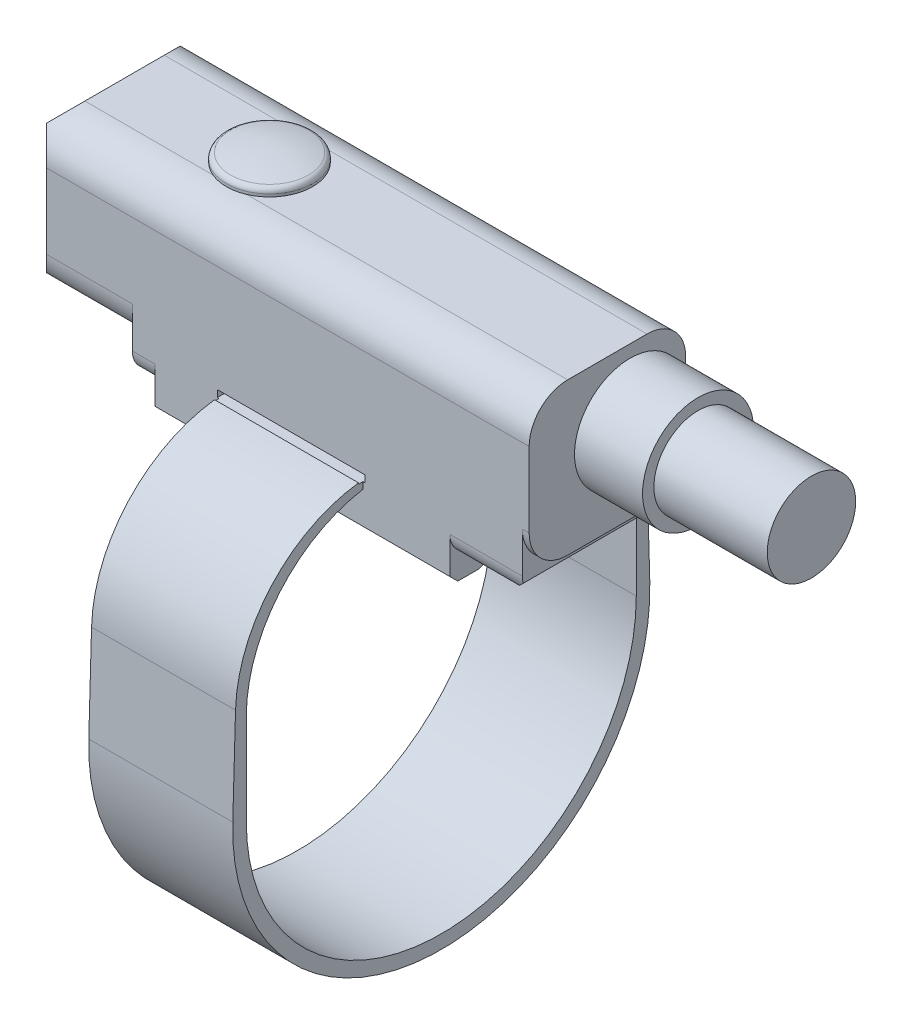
ISO-10303-21;
HEADER;
FILE_DESCRIPTION(('STEP AP214'),'2;1');
FILE_NAME('part.step','',(''),(''),'','','');
FILE_SCHEMA(('AUTOMOTIVE_DESIGN { 1 0 10303 214 1 1 1 1 }'));
ENDSEC;
DATA;
#1=APPLICATION_CONTEXT('core data for automotive mechanical design processes');
#2=APPLICATION_PROTOCOL_DEFINITION('international standard','automotive_design',2000,#1);
#3=PRODUCT_CONTEXT('',#1,'mechanical');
#4=PRODUCT('Part','Part','',(#3));
#5=PRODUCT_RELATED_PRODUCT_CATEGORY('part','',(#4));
#6=PRODUCT_DEFINITION_FORMATION('','',#4);
#7=PRODUCT_DEFINITION_CONTEXT('part definition',#1,'design');
#8=PRODUCT_DEFINITION('design','',#6,#7);
#9=PRODUCT_DEFINITION_SHAPE('','',#8);
#10=(LENGTH_UNIT() NAMED_UNIT(*) SI_UNIT(.MILLI.,.METRE.));
#11=(NAMED_UNIT(*) PLANE_ANGLE_UNIT() SI_UNIT($,.RADIAN.));
#12=(NAMED_UNIT(*) SI_UNIT($,.STERADIAN.) SOLID_ANGLE_UNIT());
#13=UNCERTAINTY_MEASURE_WITH_UNIT(LENGTH_MEASURE(1.E-05),#10,'distance_accuracy_value','');
#14=(GEOMETRIC_REPRESENTATION_CONTEXT(3) GLOBAL_UNCERTAINTY_ASSIGNED_CONTEXT((#13)) GLOBAL_UNIT_ASSIGNED_CONTEXT((#10,
#11,#12)) REPRESENTATION_CONTEXT('',''));
#15=CARTESIAN_POINT('',(0.,0.,0.));
#16=DIRECTION('',(0.,0.,1.));
#17=DIRECTION('',(1.,0.,0.));
#18=AXIS2_PLACEMENT_3D('',#15,#16,#17);
#19=CARTESIAN_POINT('',(18.5,17.1,-1.75));
#20=DIRECTION('',(0.,-1.,0.));
#21=DIRECTION('',(0.,0.,-1.));
#22=AXIS2_PLACEMENT_3D('',#19,#20,#21);
#23=PLANE('',#22);
#24=CARTESIAN_POINT('',(7.1,17.1,0.));
#25=DIRECTION('',(0.,-1.,0.));
#26=DIRECTION('',(0.,0.,-1.));
#27=AXIS2_PLACEMENT_3D('',#24,#25,#26);
#28=CIRCLE('',#27,1.9);
#29=CARTESIAN_POINT('',(6.36006757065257,17.1,1.75));
#30=VERTEX_POINT('',#29);
#31=CARTESIAN_POINT('',(6.36006757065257,17.1,-1.75));
#32=VERTEX_POINT('',#31);
#33=EDGE_CURVE('E360',#30,#32,#28,.T.);
#34=ORIENTED_EDGE('',*,*,#33,.T.);
#35=DIRECTION('',(-1.,0.,0.));
#36=VECTOR('',#35,1.);
#37=CARTESIAN_POINT('',(18.5,17.1,-1.75));
#38=LINE('',#37,#36);
#39=CARTESIAN_POINT('',(0.707106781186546,17.1,-1.75));
#40=VERTEX_POINT('',#39);
#41=EDGE_CURVE('E378',#32,#40,#38,.T.);
#42=ORIENTED_EDGE('',*,*,#41,.T.);
#43=DIRECTION('',(0.,0.,1.));
#44=VECTOR('',#43,1.);
#45=CARTESIAN_POINT('',(0.707106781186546,17.1,-5.));
#46=LINE('',#45,#44);
#47=CARTESIAN_POINT('',(0.707106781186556,17.1,1.75));
#48=VERTEX_POINT('',#47);
#49=EDGE_CURVE('E659',#40,#48,#46,.T.);
#50=ORIENTED_EDGE('',*,*,#49,.T.);
#51=DIRECTION('',(-1.,0.,0.));
#52=VECTOR('',#51,1.);
#53=CARTESIAN_POINT('',(18.5,17.1,1.75));
#54=LINE('',#53,#52);
#55=EDGE_CURVE('E512',#30,#48,#54,.T.);
#56=ORIENTED_EDGE('',*,*,#55,.F.);
#57=EDGE_LOOP('',(#34,#42,#50,#56));
#58=FACE_BOUND('',#57,.T.);
#59=ADVANCED_FACE('F16',(#58),#23,.F.);
#60=CARTESIAN_POINT('',(18.5,15.4,-1.75));
#61=DIRECTION('',(1.,0.,0.));
#62=DIRECTION('',(0.,0.,-1.));
#63=AXIS2_PLACEMENT_3D('',#60,#61,#62);
#64=PLANE('',#63);
#65=DIRECTION('',(0.,0.,-1.));
#66=VECTOR('',#65,1.);
#67=CARTESIAN_POINT('',(18.5,9.3,2.45));
#68=LINE('',#67,#66);
#69=CARTESIAN_POINT('',(18.5,9.3,2.45));
#70=VERTEX_POINT('',#69);
#71=CARTESIAN_POINT('',(18.5,9.3,-2.45));
#72=VERTEX_POINT('',#71);
#73=EDGE_CURVE('E704',#70,#72,#68,.T.);
#74=ORIENTED_EDGE('',*,*,#73,.F.);
#75=CARTESIAN_POINT('',(18.5,10.3,2.45));
#76=DIRECTION('',(1.,0.,0.));
#77=DIRECTION('',(0.,0.,-1.));
#78=AXIS2_PLACEMENT_3D('',#75,#76,#77);
#79=CIRCLE('',#78,1.);
#80=CARTESIAN_POINT('',(18.5,10.3,3.45));
#81=VERTEX_POINT('',#80);
#82=EDGE_CURVE('E680',#81,#70,#79,.T.);
#83=ORIENTED_EDGE('',*,*,#82,.F.);
#84=DIRECTION('',(0.,-1.,0.));
#85=VECTOR('',#84,1.);
#86=CARTESIAN_POINT('',(18.5,15.4,3.45));
#87=LINE('',#86,#85);
#88=CARTESIAN_POINT('',(18.5,8.68662005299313,3.45));
#89=VERTEX_POINT('',#88);
#90=EDGE_CURVE('E611',#81,#89,#87,.T.);
#91=ORIENTED_EDGE('',*,*,#90,.T.);
#92=DIRECTION('',(0.,-0.707106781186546,-0.707106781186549));
#93=VECTOR('',#92,1.);
#94=CARTESIAN_POINT('',(18.5,8.68662005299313,3.45));
#95=LINE('',#94,#93);
#96=CARTESIAN_POINT('',(18.5,8.33306666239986,3.09644660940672));
#97=VERTEX_POINT('',#96);
#98=EDGE_CURVE('E614',#89,#97,#95,.T.);
#99=ORIENTED_EDGE('',*,*,#98,.T.);
#100=DIRECTION('',(0.,0.,-1.));
#101=VECTOR('',#100,1.);
#102=CARTESIAN_POINT('',(18.5,8.33306666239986,3.09644660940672));
#103=LINE('',#102,#101);
#104=CARTESIAN_POINT('',(18.5,8.33306666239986,2.18));
#105=VERTEX_POINT('',#104);
#106=EDGE_CURVE('E825',#97,#105,#103,.T.);
#107=ORIENTED_EDGE('',*,*,#106,.T.);
#108=CARTESIAN_POINT('',(18.5,3.83333333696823,0.));
#109=DIRECTION('',(1.,0.,0.));
#110=DIRECTION('',(0.,0.,-1.));
#111=AXIS2_PLACEMENT_3D('',#108,#109,#110);
#112=CIRCLE('',#111,5.);
#113=CARTESIAN_POINT('',(18.5,8.33306666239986,-2.18));
#114=VERTEX_POINT('',#113);
#115=EDGE_CURVE('E544',#114,#105,#112,.T.);
#116=ORIENTED_EDGE('',*,*,#115,.F.);
#117=DIRECTION('',(0.,0.,-1.));
#118=VECTOR('',#117,1.);
#119=CARTESIAN_POINT('',(18.5,8.33306666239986,-2.5));
#120=LINE('',#119,#118);
#121=CARTESIAN_POINT('',(18.5,8.33306666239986,-3.09644660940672));
#122=VERTEX_POINT('',#121);
#123=EDGE_CURVE('E828',#114,#122,#120,.T.);
#124=ORIENTED_EDGE('',*,*,#123,.T.);
#125=DIRECTION('',(0.,0.707106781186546,-0.707106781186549));
#126=VECTOR('',#125,1.);
#127=CARTESIAN_POINT('',(18.5,8.33306666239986,-3.09644660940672));
#128=LINE('',#127,#126);
#129=CARTESIAN_POINT('',(18.5,8.68662005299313,-3.45));
#130=VERTEX_POINT('',#129);
#131=EDGE_CURVE('E505',#122,#130,#128,.T.);
#132=ORIENTED_EDGE('',*,*,#131,.T.);
#133=DIRECTION('',(0.,1.,0.));
#134=VECTOR('',#133,1.);
#135=CARTESIAN_POINT('',(18.5,8.68662005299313,-3.45));
#136=LINE('',#135,#134);
#137=CARTESIAN_POINT('',(18.5,10.3,-3.45));
#138=VERTEX_POINT('',#137);
#139=EDGE_CURVE('E501',#130,#138,#136,.T.);
#140=ORIENTED_EDGE('',*,*,#139,.T.);
#141=CARTESIAN_POINT('',(18.5,10.3,-2.45));
#142=DIRECTION('',(1.,0.,0.));
#143=DIRECTION('',(0.,0.,-1.));
#144=AXIS2_PLACEMENT_3D('',#141,#142,#143);
#145=CIRCLE('',#144,1.);
#146=EDGE_CURVE('E685',#72,#138,#145,.T.);
#147=ORIENTED_EDGE('',*,*,#146,.F.);
#148=EDGE_LOOP('',(#74,#83,#91,#99,#107,#116,#124,#132,#140,#147));
#149=FACE_BOUND('',#148,.T.);
#150=ADVANCED_FACE('F830',(#149),#64,.T.);
#151=CARTESIAN_POINT('',(22.,12.1,1.75));
#152=DIRECTION('',(-1.,0.,0.));
#153=DIRECTION('',(0.,0.,1.));
#154=AXIS2_PLACEMENT_3D('',#151,#152,#153);
#155=CYLINDRICAL_SURFACE('',#154,1.7);
#156=CARTESIAN_POINT('',(21.7,12.1,1.75));
#157=DIRECTION('',(-1.,0.,0.));
#158=DIRECTION('',(0.,0.,1.));
#159=AXIS2_PLACEMENT_3D('',#156,#157,#158);
#160=CIRCLE('',#159,1.7);
#161=CARTESIAN_POINT('',(21.7,10.4,1.75));
#162=VERTEX_POINT('',#161);
#163=CARTESIAN_POINT('',(21.7,12.1,3.45));
#164=VERTEX_POINT('',#163);
#165=EDGE_CURVE('E681',#162,#164,#160,.T.);
#166=ORIENTED_EDGE('',*,*,#165,.F.);
#167=DIRECTION('',(-1.,0.,0.));
#168=VECTOR('',#167,1.);
#169=CARTESIAN_POINT('',(22.,10.4,1.75));
#170=LINE('',#169,#168);
#171=CARTESIAN_POINT('',(22.,10.4,1.75));
#172=VERTEX_POINT('',#171);
#173=EDGE_CURVE('E540',#172,#162,#170,.T.);
#174=ORIENTED_EDGE('',*,*,#173,.F.);
#175=CARTESIAN_POINT('',(22.,12.1,1.75));
#176=DIRECTION('',(1.,0.,0.));
#177=DIRECTION('',(0.,0.,-1.));
#178=AXIS2_PLACEMENT_3D('',#175,#176,#177);
#179=CIRCLE('',#178,1.7);
#180=CARTESIAN_POINT('',(22.,12.1,3.45));
#181=VERTEX_POINT('',#180);
#182=EDGE_CURVE('E772',#181,#172,#179,.T.);
#183=ORIENTED_EDGE('',*,*,#182,.F.);
#184=DIRECTION('',(-1.,0.,0.));
#185=VECTOR('',#184,1.);
#186=CARTESIAN_POINT('',(22.,12.1,3.45));
#187=LINE('',#186,#185);
#188=EDGE_CURVE('E506',#181,#164,#187,.T.);
#189=ORIENTED_EDGE('',*,*,#188,.T.);
#190=EDGE_LOOP('',(#166,#174,#183,#189));
#191=FACE_BOUND('',#190,.T.);
#192=ADVANCED_FACE('F845',(#191),#155,.T.);
#193=CARTESIAN_POINT('',(22.,10.4,1.75));
#194=DIRECTION('',(0.,1.,0.));
#195=DIRECTION('',(0.,0.,1.));
#196=AXIS2_PLACEMENT_3D('',#193,#194,#195);
#197=PLANE('',#196);
#198=DIRECTION('',(0.,0.,1.));
#199=VECTOR('',#198,1.);
#200=CARTESIAN_POINT('',(21.7,10.4,-1.75));
#201=LINE('',#200,#199);
#202=CARTESIAN_POINT('',(21.7,10.4,-1.75));
#203=VERTEX_POINT('',#202);
#204=EDGE_CURVE('E698',#203,#162,#201,.T.);
#205=ORIENTED_EDGE('',*,*,#204,.F.);
#206=DIRECTION('',(-1.,0.,0.));
#207=VECTOR('',#206,1.);
#208=CARTESIAN_POINT('',(22.,10.4,-1.75));
#209=LINE('',#208,#207);
#210=CARTESIAN_POINT('',(22.,10.4,-1.75));
#211=VERTEX_POINT('',#210);
#212=EDGE_CURVE('E538',#211,#203,#209,.T.);
#213=ORIENTED_EDGE('',*,*,#212,.F.);
#214=DIRECTION('',(0.,0.,-1.));
#215=VECTOR('',#214,1.);
#216=CARTESIAN_POINT('',(22.,10.4,1.75));
#217=LINE('',#216,#215);
#218=EDGE_CURVE('E775',#172,#211,#217,.T.);
#219=ORIENTED_EDGE('',*,*,#218,.F.);
#220=ORIENTED_EDGE('',*,*,#173,.T.);
#221=EDGE_LOOP('',(#205,#213,#219,#220));
#222=FACE_BOUND('',#221,.T.);
#223=ADVANCED_FACE('F851',(#222),#197,.F.);
#224=CARTESIAN_POINT('',(22.,12.1,-1.75));
#225=DIRECTION('',(-1.,0.,0.));
#226=DIRECTION('',(0.,0.,1.));
#227=AXIS2_PLACEMENT_3D('',#224,#225,#226);
#228=CYLINDRICAL_SURFACE('',#227,1.7);
#229=CARTESIAN_POINT('',(21.7,12.1,-1.75));
#230=DIRECTION('',(-1.,0.,0.));
#231=DIRECTION('',(0.,0.,1.));
#232=AXIS2_PLACEMENT_3D('',#229,#230,#231);
#233=CIRCLE('',#232,1.7);
#234=CARTESIAN_POINT('',(21.7,12.1,-3.45));
#235=VERTEX_POINT('',#234);
#236=EDGE_CURVE('E695',#235,#203,#233,.T.);
#237=ORIENTED_EDGE('',*,*,#236,.F.);
#238=DIRECTION('',(-1.,0.,0.));
#239=VECTOR('',#238,1.);
#240=CARTESIAN_POINT('',(22.,12.1,-3.45));
#241=LINE('',#240,#239);
#242=CARTESIAN_POINT('',(22.,12.1,-3.45));
#243=VERTEX_POINT('',#242);
#244=EDGE_CURVE('E541',#243,#235,#241,.T.);
#245=ORIENTED_EDGE('',*,*,#244,.F.);
#246=CARTESIAN_POINT('',(22.,12.1,-1.75));
#247=DIRECTION('',(1.,0.,0.));
#248=DIRECTION('',(0.,0.,-1.));
#249=AXIS2_PLACEMENT_3D('',#246,#247,#248);
#250=CIRCLE('',#249,1.7);
#251=EDGE_CURVE('E777',#211,#243,#250,.T.);
#252=ORIENTED_EDGE('',*,*,#251,.F.);
#253=ORIENTED_EDGE('',*,*,#212,.T.);
#254=EDGE_LOOP('',(#237,#245,#252,#253));
#255=FACE_BOUND('',#254,.T.);
#256=ADVANCED_FACE('F853',(#255),#228,.T.);
#257=CARTESIAN_POINT('',(5.5,10.3,-2.45));
#258=DIRECTION('',(-1.,0.,0.));
#259=DIRECTION('',(0.,0.,1.));
#260=AXIS2_PLACEMENT_3D('',#257,#258,#259);
#261=PLANE('',#260);
#262=DIRECTION('',(0.,0.,-1.));
#263=VECTOR('',#262,1.);
#264=CARTESIAN_POINT('',(5.5,8.33306666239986,-2.5));
#265=LINE('',#264,#263);
#266=CARTESIAN_POINT('',(5.5,8.33306666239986,-2.18));
#267=VERTEX_POINT('',#266);
#268=CARTESIAN_POINT('',(5.5,8.33306666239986,-3.09644660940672));
#269=VERTEX_POINT('',#268);
#270=EDGE_CURVE('E561',#267,#269,#265,.T.);
#271=ORIENTED_EDGE('',*,*,#270,.F.);
#272=CARTESIAN_POINT('',(5.5,3.83333333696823,0.));
#273=DIRECTION('',(-1.,0.,0.));
#274=DIRECTION('',(0.,0.,1.));
#275=AXIS2_PLACEMENT_3D('',#272,#273,#274);
#276=CIRCLE('',#275,5.);
#277=CARTESIAN_POINT('',(5.5,8.33306666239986,2.18));
#278=VERTEX_POINT('',#277);
#279=EDGE_CURVE('E497',#267,#278,#276,.F.);
#280=ORIENTED_EDGE('',*,*,#279,.T.);
#281=DIRECTION('',(0.,0.,-1.));
#282=VECTOR('',#281,1.);
#283=CARTESIAN_POINT('',(5.5,8.33306666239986,3.09644660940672));
#284=LINE('',#283,#282);
#285=CARTESIAN_POINT('',(5.5,8.33306666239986,3.09644660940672));
#286=VERTEX_POINT('',#285);
#287=EDGE_CURVE('E559',#286,#278,#284,.T.);
#288=ORIENTED_EDGE('',*,*,#287,.F.);
#289=DIRECTION('',(0.,-0.707106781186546,-0.707106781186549));
#290=VECTOR('',#289,1.);
#291=CARTESIAN_POINT('',(5.5,8.68662005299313,3.45));
#292=LINE('',#291,#290);
#293=CARTESIAN_POINT('',(5.5,8.68662005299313,3.45));
#294=VERTEX_POINT('',#293);
#295=EDGE_CURVE('E556',#294,#286,#292,.T.);
#296=ORIENTED_EDGE('',*,*,#295,.F.);
#297=DIRECTION('',(0.,-1.,0.));
#298=VECTOR('',#297,1.);
#299=CARTESIAN_POINT('',(5.5,10.3,3.45));
#300=LINE('',#299,#298);
#301=CARTESIAN_POINT('',(5.5,10.3,3.45));
#302=VERTEX_POINT('',#301);
#303=EDGE_CURVE('E553',#302,#294,#300,.T.);
#304=ORIENTED_EDGE('',*,*,#303,.F.);
#305=CARTESIAN_POINT('',(5.5,10.3,2.45));
#306=DIRECTION('',(-1.,0.,0.));
#307=DIRECTION('',(0.,0.,1.));
#308=AXIS2_PLACEMENT_3D('',#305,#306,#307);
#309=CIRCLE('',#308,1.);
#310=CARTESIAN_POINT('',(5.5,9.3,2.45));
#311=VERTEX_POINT('',#310);
#312=EDGE_CURVE('E574',#311,#302,#309,.T.);
#313=ORIENTED_EDGE('',*,*,#312,.F.);
#314=DIRECTION('',(0.,0.,1.));
#315=VECTOR('',#314,1.);
#316=CARTESIAN_POINT('',(5.5,9.3,-2.45));
#317=LINE('',#316,#315);
#318=CARTESIAN_POINT('',(5.5,9.3,-2.45));
#319=VERTEX_POINT('',#318);
#320=EDGE_CURVE('E572',#319,#311,#317,.T.);
#321=ORIENTED_EDGE('',*,*,#320,.F.);
#322=CARTESIAN_POINT('',(5.5,10.3,-2.45));
#323=DIRECTION('',(-1.,0.,0.));
#324=DIRECTION('',(0.,0.,1.));
#325=AXIS2_PLACEMENT_3D('',#322,#323,#324);
#326=CIRCLE('',#325,1.);
#327=CARTESIAN_POINT('',(5.5,10.3,-3.45));
#328=VERTEX_POINT('',#327);
#329=EDGE_CURVE('E570',#328,#319,#326,.T.);
#330=ORIENTED_EDGE('',*,*,#329,.F.);
#331=DIRECTION('',(0.,1.,0.));
#332=VECTOR('',#331,1.);
#333=CARTESIAN_POINT('',(5.5,8.68662005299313,-3.45));
#334=LINE('',#333,#332);
#335=CARTESIAN_POINT('',(5.5,8.68662005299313,-3.45));
#336=VERTEX_POINT('',#335);
#337=EDGE_CURVE('E567',#336,#328,#334,.T.);
#338=ORIENTED_EDGE('',*,*,#337,.F.);
#339=DIRECTION('',(0.,0.707106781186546,-0.707106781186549));
#340=VECTOR('',#339,1.);
#341=CARTESIAN_POINT('',(5.5,8.33306666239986,-3.09644660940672));
#342=LINE('',#341,#340);
#343=EDGE_CURVE('E564',#269,#336,#342,.T.);
#344=ORIENTED_EDGE('',*,*,#343,.F.);
#345=EDGE_LOOP('',(#271,#280,#288,#296,#304,#313,#321,#330,#338,#344));
#346=FACE_BOUND('',#345,.T.);
#347=ADVANCED_FACE('F816',(#346),#261,.T.);
#348=CARTESIAN_POINT('',(18.5,15.4,3.45));
#349=DIRECTION('',(0.,0.,-1.));
#350=DIRECTION('',(-1.,0.,0.));
#351=AXIS2_PLACEMENT_3D('',#348,#349,#350);
#352=PLANE('',#351);
#353=DIRECTION('',(-1.,0.,0.));
#354=VECTOR('',#353,1.);
#355=CARTESIAN_POINT('',(18.5,15.4,3.45));
#356=LINE('',#355,#354);
#357=CARTESIAN_POINT('',(22.,15.4,3.45));
#358=VERTEX_POINT('',#357);
#359=CARTESIAN_POINT('',(0.707106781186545,15.4,3.45));
#360=VERTEX_POINT('',#359);
#361=EDGE_CURVE('E504',#358,#360,#356,.T.);
#362=ORIENTED_EDGE('',*,*,#361,.T.);
#363=DIRECTION('',(0.,1.,0.));
#364=VECTOR('',#363,1.);
#365=CARTESIAN_POINT('',(0.707106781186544,7.1,3.45));
#366=LINE('',#365,#364);
#367=CARTESIAN_POINT('',(0.707106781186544,12.1,3.45));
#368=VERTEX_POINT('',#367);
#369=EDGE_CURVE('E379',#368,#360,#366,.T.);
#370=ORIENTED_EDGE('',*,*,#369,.F.);
#371=DIRECTION('',(-1.,0.,0.));
#372=VECTOR('',#371,1.);
#373=CARTESIAN_POINT('',(4.5,12.1,3.45));
#374=LINE('',#373,#372);
#375=CARTESIAN_POINT('',(4.5,12.1,3.45));
#376=VERTEX_POINT('',#375);
#377=EDGE_CURVE('E608',#376,#368,#374,.T.);
#378=ORIENTED_EDGE('',*,*,#377,.F.);
#379=DIRECTION('',(0.,-1.,0.));
#380=VECTOR('',#379,1.);
#381=CARTESIAN_POINT('',(4.5,12.1,3.45));
#382=LINE('',#381,#380);
#383=CARTESIAN_POINT('',(4.5,10.3,3.45));
#384=VERTEX_POINT('',#383);
#385=EDGE_CURVE('E590',#376,#384,#382,.T.);
#386=ORIENTED_EDGE('',*,*,#385,.T.);
#387=DIRECTION('',(-1.,0.,0.));
#388=VECTOR('',#387,1.);
#389=CARTESIAN_POINT('',(5.5,10.3,3.45));
#390=LINE('',#389,#388);
#391=EDGE_CURVE('E576',#302,#384,#390,.T.);
#392=ORIENTED_EDGE('',*,*,#391,.F.);
#393=ORIENTED_EDGE('',*,*,#303,.T.);
#394=DIRECTION('',(-1.,0.,0.));
#395=VECTOR('',#394,1.);
#396=CARTESIAN_POINT('',(18.5,8.68662005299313,3.45));
#397=LINE('',#396,#395);
#398=EDGE_CURVE('E401',#89,#294,#397,.T.);
#399=ORIENTED_EDGE('',*,*,#398,.F.);
#400=ORIENTED_EDGE('',*,*,#90,.F.);
#401=DIRECTION('',(-1.,0.,0.));
#402=VECTOR('',#401,1.);
#403=CARTESIAN_POINT('',(21.7,10.3,3.45));
#404=LINE('',#403,#402);
#405=CARTESIAN_POINT('',(21.7,10.3,3.45));
#406=VERTEX_POINT('',#405);
#407=EDGE_CURVE('E715',#406,#81,#404,.T.);
#408=ORIENTED_EDGE('',*,*,#407,.F.);
#409=DIRECTION('',(0.,-1.,0.));
#410=VECTOR('',#409,1.);
#411=CARTESIAN_POINT('',(21.7,12.1,3.45));
#412=LINE('',#411,#410);
#413=EDGE_CURVE('E684',#164,#406,#412,.T.);
#414=ORIENTED_EDGE('',*,*,#413,.F.);
#415=ORIENTED_EDGE('',*,*,#188,.F.);
#416=DIRECTION('',(0.,-1.,0.));
#417=VECTOR('',#416,1.);
#418=CARTESIAN_POINT('',(22.,15.4,3.45));
#419=LINE('',#418,#417);
#420=EDGE_CURVE('E531',#358,#181,#419,.T.);
#421=ORIENTED_EDGE('',*,*,#420,.F.);
#422=EDGE_LOOP('',(#362,#370,#378,#386,#392,#393,#399,#400,#408,#414,#415,#421));
#423=FACE_BOUND('',#422,.T.);
#424=DIRECTION('',(0.,1.,0.));
#425=VECTOR('',#424,1.);
#426=CARTESIAN_POINT('',(8.325,0.,3.45));
#427=LINE('',#426,#425);
#428=CARTESIAN_POINT('',(8.325,10.1104418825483,3.45));
#429=VERTEX_POINT('',#428);
#430=CARTESIAN_POINT('',(8.325,10.4,3.45));
#431=VERTEX_POINT('',#430);
#432=EDGE_CURVE('E485',#429,#431,#427,.T.);
#433=ORIENTED_EDGE('',*,*,#432,.T.);
#434=DIRECTION('',(-1.,0.,0.));
#435=VECTOR('',#434,1.);
#436=CARTESIAN_POINT('',(18.5,10.4,3.45));
#437=LINE('',#436,#435);
#438=CARTESIAN_POINT('',(8.25,10.4,3.45));
#439=VERTEX_POINT('',#438);
#440=EDGE_CURVE('E755',#431,#439,#437,.T.);
#441=ORIENTED_EDGE('',*,*,#440,.T.);
#442=DIRECTION('',(0.,-1.,0.));
#443=VECTOR('',#442,1.);
#444=CARTESIAN_POINT('',(8.25,15.4,3.45));
#445=LINE('',#444,#443);
#446=CARTESIAN_POINT('',(8.25,10.7,3.45));
#447=VERTEX_POINT('',#446);
#448=EDGE_CURVE('E746',#447,#439,#445,.T.);
#449=ORIENTED_EDGE('',*,*,#448,.F.);
#450=DIRECTION('',(1.,0.,0.));
#451=VECTOR('',#450,1.);
#452=CARTESIAN_POINT('',(18.5,10.7,3.45));
#453=LINE('',#452,#451);
#454=CARTESIAN_POINT('',(14.75,10.7,3.45));
#455=VERTEX_POINT('',#454);
#456=EDGE_CURVE('E759',#447,#455,#453,.T.);
#457=ORIENTED_EDGE('',*,*,#456,.T.);
#458=DIRECTION('',(0.,-1.,0.));
#459=VECTOR('',#458,1.);
#460=CARTESIAN_POINT('',(14.75,15.4,3.45));
#461=LINE('',#460,#459);
#462=CARTESIAN_POINT('',(14.75,10.4,3.45));
#463=VERTEX_POINT('',#462);
#464=EDGE_CURVE('E741',#455,#463,#461,.T.);
#465=ORIENTED_EDGE('',*,*,#464,.T.);
#466=CARTESIAN_POINT('',(14.675,10.4,3.45));
#467=VERTEX_POINT('',#466);
#468=EDGE_CURVE('E758',#463,#467,#437,.T.);
#469=ORIENTED_EDGE('',*,*,#468,.T.);
#470=DIRECTION('',(0.,1.,0.));
#471=VECTOR('',#470,1.);
#472=CARTESIAN_POINT('',(14.675,0.,3.45));
#473=LINE('',#472,#471);
#474=CARTESIAN_POINT('',(14.675,10.1104418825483,3.45));
#475=VERTEX_POINT('',#474);
#476=EDGE_CURVE('E411',#475,#467,#473,.T.);
#477=ORIENTED_EDGE('',*,*,#476,.F.);
#478=DIRECTION('',(-1.,0.,0.));
#479=VECTOR('',#478,1.);
#480=CARTESIAN_POINT('',(14.675,10.1104418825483,3.45));
#481=LINE('',#480,#479);
#482=EDGE_CURVE('E409',#429,#475,#481,.F.);
#483=ORIENTED_EDGE('',*,*,#482,.F.);
#484=EDGE_LOOP('',(#433,#441,#449,#457,#465,#469,#477,#483));
#485=FACE_BOUND('',#484,.T.);
#486=ADVANCED_FACE('F795',(#423,#485),#352,.F.);
#487=CARTESIAN_POINT('',(18.5,8.68662005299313,3.45));
#488=DIRECTION('',(0.,0.707106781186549,-0.707106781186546));
#489=DIRECTION('',(0.,0.707106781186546,0.707106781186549));
#490=AXIS2_PLACEMENT_3D('',#487,#488,#489);
#491=PLANE('',#490);
#492=ORIENTED_EDGE('',*,*,#295,.T.);
#493=DIRECTION('',(-1.,0.,0.));
#494=VECTOR('',#493,1.);
#495=CARTESIAN_POINT('',(18.5,8.33306666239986,3.09644660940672));
#496=LINE('',#495,#494);
#497=EDGE_CURVE('E398',#97,#286,#496,.T.);
#498=ORIENTED_EDGE('',*,*,#497,.F.);
#499=ORIENTED_EDGE('',*,*,#98,.F.);
#500=ORIENTED_EDGE('',*,*,#398,.T.);
#501=EDGE_LOOP('',(#492,#498,#499,#500));
#502=FACE_BOUND('',#501,.T.);
#503=ADVANCED_FACE('F819',(#502),#491,.F.);
#504=CARTESIAN_POINT('',(18.5,8.33306666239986,3.09644660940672));
#505=DIRECTION('',(0.,1.,0.));
#506=DIRECTION('',(0.,0.,1.));
#507=AXIS2_PLACEMENT_3D('',#504,#505,#506);
#508=PLANE('',#507);
#509=ORIENTED_EDGE('',*,*,#287,.T.);
#510=DIRECTION('',(-1.,0.,0.));
#511=VECTOR('',#510,1.);
#512=CARTESIAN_POINT('',(18.5,8.33306666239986,2.18));
#513=LINE('',#512,#511);
#514=EDGE_CURVE('E547',#105,#278,#513,.T.);
#515=ORIENTED_EDGE('',*,*,#514,.F.);
#516=ORIENTED_EDGE('',*,*,#106,.F.);
#517=ORIENTED_EDGE('',*,*,#497,.T.);
#518=EDGE_LOOP('',(#509,#515,#516,#517));
#519=FACE_BOUND('',#518,.T.);
#520=ADVANCED_FACE('F823',(#519),#508,.F.);
#521=CARTESIAN_POINT('',(18.5,8.33306666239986,-2.5));
#522=DIRECTION('',(0.,1.,0.));
#523=DIRECTION('',(0.,0.,1.));
#524=AXIS2_PLACEMENT_3D('',#521,#522,#523);
#525=PLANE('',#524);
#526=ORIENTED_EDGE('',*,*,#270,.T.);
#527=DIRECTION('',(-1.,0.,0.));
#528=VECTOR('',#527,1.);
#529=CARTESIAN_POINT('',(18.5,8.33306666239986,-3.09644660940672));
#530=LINE('',#529,#528);
#531=EDGE_CURVE('E395',#122,#269,#530,.T.);
#532=ORIENTED_EDGE('',*,*,#531,.F.);
#533=ORIENTED_EDGE('',*,*,#123,.F.);
#534=DIRECTION('',(-1.,0.,0.));
#535=VECTOR('',#534,1.);
#536=CARTESIAN_POINT('',(18.5,8.33306666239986,-2.18));
#537=LINE('',#536,#535);
#538=EDGE_CURVE('E550',#114,#267,#537,.T.);
#539=ORIENTED_EDGE('',*,*,#538,.T.);
#540=EDGE_LOOP('',(#526,#532,#533,#539));
#541=FACE_BOUND('',#540,.T.);
#542=ADVANCED_FACE('F994',(#541),#525,.F.);
#543=CARTESIAN_POINT('',(18.5,8.33306666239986,-3.09644660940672));
#544=DIRECTION('',(0.,0.707106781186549,0.707106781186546));
#545=DIRECTION('',(0.,-0.707106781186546,0.707106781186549));
#546=AXIS2_PLACEMENT_3D('',#543,#544,#545);
#547=PLANE('',#546);
#548=ORIENTED_EDGE('',*,*,#343,.T.);
#549=DIRECTION('',(-1.,0.,0.));
#550=VECTOR('',#549,1.);
#551=CARTESIAN_POINT('',(18.5,8.68662005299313,-3.45));
#552=LINE('',#551,#550);
#553=EDGE_CURVE('E387',#130,#336,#552,.T.);
#554=ORIENTED_EDGE('',*,*,#553,.F.);
#555=ORIENTED_EDGE('',*,*,#131,.F.);
#556=ORIENTED_EDGE('',*,*,#531,.T.);
#557=EDGE_LOOP('',(#548,#554,#555,#556));
#558=FACE_BOUND('',#557,.T.);
#559=ADVANCED_FACE('F991',(#558),#547,.F.);
#560=CARTESIAN_POINT('',(4.5,12.1,1.75));
#561=DIRECTION('',(-1.,0.,0.));
#562=DIRECTION('',(0.,0.,1.));
#563=AXIS2_PLACEMENT_3D('',#560,#561,#562);
#564=PLANE('',#563);
#565=DIRECTION('',(0.,1.,0.));
#566=VECTOR('',#565,1.);
#567=CARTESIAN_POINT('',(4.5,8.68662005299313,-3.45));
#568=LINE('',#567,#566);
#569=CARTESIAN_POINT('',(4.5,10.3,-3.45));
#570=VERTEX_POINT('',#569);
#571=CARTESIAN_POINT('',(4.5,12.1,-3.45));
#572=VERTEX_POINT('',#571);
#573=EDGE_CURVE('E593',#570,#572,#568,.T.);
#574=ORIENTED_EDGE('',*,*,#573,.F.);
#575=CARTESIAN_POINT('',(4.5,10.3,-2.45));
#576=DIRECTION('',(-1.,0.,0.));
#577=DIRECTION('',(0.,0.,1.));
#578=AXIS2_PLACEMENT_3D('',#575,#576,#577);
#579=CIRCLE('',#578,1.);
#580=CARTESIAN_POINT('',(4.5,9.3,-2.45));
#581=VERTEX_POINT('',#580);
#582=EDGE_CURVE('E494',#570,#581,#579,.T.);
#583=ORIENTED_EDGE('',*,*,#582,.T.);
#584=DIRECTION('',(0.,0.,1.));
#585=VECTOR('',#584,1.);
#586=CARTESIAN_POINT('',(4.5,9.3,1.75));
#587=LINE('',#586,#585);
#588=CARTESIAN_POINT('',(4.5,9.3,2.45));
#589=VERTEX_POINT('',#588);
#590=EDGE_CURVE('E491',#581,#589,#587,.T.);
#591=ORIENTED_EDGE('',*,*,#590,.T.);
#592=CARTESIAN_POINT('',(4.5,10.3,2.45));
#593=DIRECTION('',(-1.,0.,0.));
#594=DIRECTION('',(0.,0.,1.));
#595=AXIS2_PLACEMENT_3D('',#592,#593,#594);
#596=CIRCLE('',#595,1.);
#597=EDGE_CURVE('E488',#589,#384,#596,.T.);
#598=ORIENTED_EDGE('',*,*,#597,.T.);
#599=ORIENTED_EDGE('',*,*,#385,.F.);
#600=CARTESIAN_POINT('',(4.5,12.1,1.75));
#601=DIRECTION('',(-1.,0.,0.));
#602=DIRECTION('',(0.,0.,1.));
#603=AXIS2_PLACEMENT_3D('',#600,#601,#602);
#604=CIRCLE('',#603,1.7);
#605=CARTESIAN_POINT('',(4.5,10.4,1.75));
#606=VERTEX_POINT('',#605);
#607=EDGE_CURVE('E587',#606,#376,#604,.T.);
#608=ORIENTED_EDGE('',*,*,#607,.F.);
#609=DIRECTION('',(0.,0.,1.));
#610=VECTOR('',#609,1.);
#611=CARTESIAN_POINT('',(4.5,10.4,-1.75));
#612=LINE('',#611,#610);
#613=CARTESIAN_POINT('',(4.5,10.4,-1.75));
#614=VERTEX_POINT('',#613);
#615=EDGE_CURVE('E597',#614,#606,#612,.T.);
#616=ORIENTED_EDGE('',*,*,#615,.F.);
#617=CARTESIAN_POINT('',(4.5,12.1,-1.75));
#618=DIRECTION('',(-1.,0.,0.));
#619=DIRECTION('',(0.,0.,1.));
#620=AXIS2_PLACEMENT_3D('',#617,#618,#619);
#621=CIRCLE('',#620,1.7);
#622=EDGE_CURVE('E595',#572,#614,#621,.T.);
#623=ORIENTED_EDGE('',*,*,#622,.F.);
#624=EDGE_LOOP('',(#574,#583,#591,#598,#599,#608,#616,#623));
#625=FACE_BOUND('',#624,.T.);
#626=ADVANCED_FACE('F805',(#625),#564,.T.);
#627=CARTESIAN_POINT('',(0.,15.4,-1.75));
#628=DIRECTION('',(1.,0.,0.));
#629=DIRECTION('',(0.,0.,-1.));
#630=AXIS2_PLACEMENT_3D('',#627,#628,#629);
#631=PLANE('',#630);
#632=DIRECTION('',(0.,0.,1.));
#633=VECTOR('',#632,1.);
#634=CARTESIAN_POINT('',(0.,16.3928932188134,-5.));
#635=LINE('',#634,#633);
#636=CARTESIAN_POINT('',(0.,16.3928932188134,-2.74289321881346));
#637=VERTEX_POINT('',#636);
#638=CARTESIAN_POINT('',(0.,16.3928932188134,2.74289321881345));
#639=VERTEX_POINT('',#638);
#640=EDGE_CURVE('E635',#637,#639,#635,.T.);
#641=ORIENTED_EDGE('',*,*,#640,.F.);
#642=DIRECTION('',(0.,1.,0.));
#643=VECTOR('',#642,1.);
#644=CARTESIAN_POINT('',(0.,7.1,-2.74289321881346));
#645=LINE('',#644,#643);
#646=CARTESIAN_POINT('',(0.,11.1071067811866,-2.74289321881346));
#647=VERTEX_POINT('',#646);
#648=EDGE_CURVE('E644',#647,#637,#645,.T.);
#649=ORIENTED_EDGE('',*,*,#648,.F.);
#650=DIRECTION('',(0.,0.,1.));
#651=VECTOR('',#650,1.);
#652=CARTESIAN_POINT('',(0.,11.1071067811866,-5.));
#653=LINE('',#652,#651);
#654=CARTESIAN_POINT('',(0.,11.1071067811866,2.74289321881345));
#655=VERTEX_POINT('',#654);
#656=EDGE_CURVE('E658',#647,#655,#653,.T.);
#657=ORIENTED_EDGE('',*,*,#656,.T.);
#658=DIRECTION('',(0.,1.,0.));
#659=VECTOR('',#658,1.);
#660=CARTESIAN_POINT('',(0.,7.1,2.74289321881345));
#661=LINE('',#660,#659);
#662=EDGE_CURVE('E790',#655,#639,#661,.T.);
#663=ORIENTED_EDGE('',*,*,#662,.T.);
#664=EDGE_LOOP('',(#641,#649,#657,#663));
#665=FACE_BOUND('',#664,.T.);
#666=ADVANCED_FACE('F1015',(#665),#631,.F.);
#667=CARTESIAN_POINT('',(14.675,0.,0.));
#668=DIRECTION('',(1.,0.,0.));
#669=DIRECTION('',(0.,0.,-1.));
#670=AXIS2_PLACEMENT_3D('',#667,#668,#669);
#671=PLANE('',#670);
#672=DIRECTION('',(0.,-1.,0.));
#673=VECTOR('',#672,1.);
#674=CARTESIAN_POINT('',(14.675,0.,3.65));
#675=LINE('',#674,#673);
#676=CARTESIAN_POINT('',(14.675,10.4516010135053,3.65));
#677=VERTEX_POINT('',#676);
#678=CARTESIAN_POINT('',(14.675,10.4,3.65));
#679=VERTEX_POINT('',#678);
#680=EDGE_CURVE('E770',#677,#679,#675,.T.);
#681=ORIENTED_EDGE('',*,*,#680,.F.);
#682=CARTESIAN_POINT('',(14.675,4.3,2.87682151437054));
#683=DIRECTION('',(1.,0.,0.));
#684=DIRECTION('',(0.,0.,-1.));
#685=AXIS2_PLACEMENT_3D('',#682,#683,#684);
#686=CIRCLE('',#685,6.2);
#687=CARTESIAN_POINT('',(14.675,4.47934189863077,9.07422713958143));
#688=VERTEX_POINT('',#687);
#689=EDGE_CURVE('E470',#677,#688,#686,.T.);
#690=ORIENTED_EDGE('',*,*,#689,.T.);
#691=DIRECTION('',(0.,-0.999581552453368,0.0289261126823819));
#692=VECTOR('',#691,1.);
#693=CARTESIAN_POINT('',(14.675,4.47934189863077,9.07422713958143));
#694=LINE('',#693,#692);
#695=CARTESIAN_POINT('',(14.675,0.266120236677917,9.19615028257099));
#696=VERTEX_POINT('',#695);
#697=EDGE_CURVE('E472',#688,#696,#694,.T.);
#698=ORIENTED_EDGE('',*,*,#697,.T.);
#699=CARTESIAN_POINT('',(14.675,0.,0.));
#700=DIRECTION('',(1.,0.,0.));
#701=DIRECTION('',(0.,0.,-1.));
#702=AXIS2_PLACEMENT_3D('',#699,#700,#701);
#703=CIRCLE('',#702,9.2);
#704=CARTESIAN_POINT('',(14.675,0.266120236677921,-9.19615028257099));
#705=VERTEX_POINT('',#704);
#706=EDGE_CURVE('E462',#696,#705,#703,.T.);
#707=ORIENTED_EDGE('',*,*,#706,.T.);
#708=DIRECTION('',(0.,0.999581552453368,0.0289261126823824));
#709=VECTOR('',#708,1.);
#710=CARTESIAN_POINT('',(14.675,0.266120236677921,-9.19615028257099));
#711=LINE('',#710,#709);
#712=CARTESIAN_POINT('',(14.675,4.47934189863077,-9.07422713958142));
#713=VERTEX_POINT('',#712);
#714=EDGE_CURVE('E465',#705,#713,#711,.T.);
#715=ORIENTED_EDGE('',*,*,#714,.T.);
#716=CARTESIAN_POINT('',(14.675,4.3,-2.87682151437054));
#717=DIRECTION('',(1.,0.,0.));
#718=DIRECTION('',(0.,0.,-1.));
#719=AXIS2_PLACEMENT_3D('',#716,#717,#718);
#720=CIRCLE('',#719,6.2);
#721=CARTESIAN_POINT('',(14.675,10.4516010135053,-3.65));
#722=VERTEX_POINT('',#721);
#723=EDGE_CURVE('E467',#713,#722,#720,.T.);
#724=ORIENTED_EDGE('',*,*,#723,.T.);
#725=DIRECTION('',(0.,1.,0.));
#726=VECTOR('',#725,1.);
#727=CARTESIAN_POINT('',(14.675,0.,-3.65));
#728=LINE('',#727,#726);
#729=CARTESIAN_POINT('',(14.675,10.4,-3.65));
#730=VERTEX_POINT('',#729);
#731=EDGE_CURVE('E765',#730,#722,#728,.T.);
#732=ORIENTED_EDGE('',*,*,#731,.F.);
#733=DIRECTION('',(0.,0.,-1.));
#734=VECTOR('',#733,1.);
#735=CARTESIAN_POINT('',(14.675,10.4,0.));
#736=LINE('',#735,#734);
#737=CARTESIAN_POINT('',(14.675,10.4,-3.45));
#738=VERTEX_POINT('',#737);
#739=EDGE_CURVE('E748',#738,#730,#736,.T.);
#740=ORIENTED_EDGE('',*,*,#739,.F.);
#741=DIRECTION('',(0.,-1.,0.));
#742=VECTOR('',#741,1.);
#743=CARTESIAN_POINT('',(14.675,0.,-3.45));
#744=LINE('',#743,#742);
#745=CARTESIAN_POINT('',(14.675,10.1104418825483,-3.45));
#746=VERTEX_POINT('',#745);
#747=EDGE_CURVE('E407',#738,#746,#744,.T.);
#748=ORIENTED_EDGE('',*,*,#747,.T.);
#749=CARTESIAN_POINT('',(14.675,4.,-2.4));
#750=DIRECTION('',(1.,0.,0.));
#751=DIRECTION('',(0.,0.,-1.));
#752=AXIS2_PLACEMENT_3D('',#749,#750,#751);
#753=CIRCLE('',#752,6.2);
#754=CARTESIAN_POINT('',(14.675,4.,-8.6));
#755=VERTEX_POINT('',#754);
#756=EDGE_CURVE('E450',#755,#746,#753,.T.);
#757=ORIENTED_EDGE('',*,*,#756,.F.);
#758=DIRECTION('',(0.,1.,0.));
#759=VECTOR('',#758,1.);
#760=CARTESIAN_POINT('',(14.675,0.,-8.6));
#761=LINE('',#760,#759);
#762=CARTESIAN_POINT('',(14.675,0.,-8.6));
#763=VERTEX_POINT('',#762);
#764=EDGE_CURVE('E448',#763,#755,#761,.T.);
#765=ORIENTED_EDGE('',*,*,#764,.F.);
#766=CARTESIAN_POINT('',(14.675,0.,0.));
#767=DIRECTION('',(1.,0.,0.));
#768=DIRECTION('',(0.,0.,-1.));
#769=AXIS2_PLACEMENT_3D('',#766,#767,#768);
#770=CIRCLE('',#769,8.6);
#771=CARTESIAN_POINT('',(14.675,0.,8.6));
#772=VERTEX_POINT('',#771);
#773=EDGE_CURVE('E446',#772,#763,#770,.T.);
#774=ORIENTED_EDGE('',*,*,#773,.F.);
#775=DIRECTION('',(0.,-1.,0.));
#776=VECTOR('',#775,1.);
#777=CARTESIAN_POINT('',(14.675,4.,8.6));
#778=LINE('',#777,#776);
#779=CARTESIAN_POINT('',(14.675,4.,8.6));
#780=VERTEX_POINT('',#779);
#781=EDGE_CURVE('E444',#780,#772,#778,.T.);
#782=ORIENTED_EDGE('',*,*,#781,.F.);
#783=CARTESIAN_POINT('',(14.675,4.,2.4));
#784=DIRECTION('',(1.,0.,0.));
#785=DIRECTION('',(0.,0.,-1.));
#786=AXIS2_PLACEMENT_3D('',#783,#784,#785);
#787=CIRCLE('',#786,6.2);
#788=EDGE_CURVE('E442',#475,#780,#787,.T.);
#789=ORIENTED_EDGE('',*,*,#788,.F.);
#790=ORIENTED_EDGE('',*,*,#476,.T.);
#791=EDGE_CURVE('E751',#679,#467,#736,.T.);
#792=ORIENTED_EDGE('',*,*,#791,.F.);
#793=EDGE_LOOP('',(#681,#690,#698,#707,#715,#724,#732,#740,#748,#757,#765,#774,#782,#789,#790,#792));
#794=FACE_BOUND('',#793,.T.);
#795=ADVANCED_FACE('F891',(#794),#671,.T.);
#796=CARTESIAN_POINT('',(14.675,4.3,-2.87682151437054));
#797=DIRECTION('',(-1.,0.,0.));
#798=DIRECTION('',(0.,0.,1.));
#799=AXIS2_PLACEMENT_3D('',#796,#797,#798);
#800=CYLINDRICAL_SURFACE('',#799,6.2);
#801=CARTESIAN_POINT('',(8.325,4.3,-2.87682151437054));
#802=DIRECTION('',(1.,0.,0.));
#803=DIRECTION('',(0.,0.,-1.));
#804=AXIS2_PLACEMENT_3D('',#801,#802,#803);
#805=CIRCLE('',#804,6.2);
#806=CARTESIAN_POINT('',(8.325,4.47934189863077,-9.07422713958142));
#807=VERTEX_POINT('',#806);
#808=CARTESIAN_POINT('',(8.325,10.4516010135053,-3.65));
#809=VERTEX_POINT('',#808);
#810=EDGE_CURVE('E434',#807,#809,#805,.T.);
#811=ORIENTED_EDGE('',*,*,#810,.T.);
#812=DIRECTION('',(-1.,0.,0.));
#813=VECTOR('',#812,1.);
#814=CARTESIAN_POINT('',(14.675,10.4516010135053,-3.65));
#815=LINE('',#814,#813);
#816=EDGE_CURVE('E762',#809,#722,#815,.F.);
#817=ORIENTED_EDGE('',*,*,#816,.T.);
#818=ORIENTED_EDGE('',*,*,#723,.F.);
#819=DIRECTION('',(-1.,0.,0.));
#820=VECTOR('',#819,1.);
#821=CARTESIAN_POINT('',(14.675,4.47934189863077,-9.07422713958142));
#822=LINE('',#821,#820);
#823=EDGE_CURVE('E479',#713,#807,#822,.T.);
#824=ORIENTED_EDGE('',*,*,#823,.T.);
#825=EDGE_LOOP('',(#811,#817,#818,#824));
#826=FACE_BOUND('',#825,.T.);
#827=ADVANCED_FACE('F948',(#826),#800,.T.);
#828=CARTESIAN_POINT('',(14.675,4.3,2.87682151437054));
#829=DIRECTION('',(-1.,0.,0.));
#830=DIRECTION('',(0.,0.,1.));
#831=AXIS2_PLACEMENT_3D('',#828,#829,#830);
#832=CYLINDRICAL_SURFACE('',#831,6.2);
#833=ORIENTED_EDGE('',*,*,#689,.F.);
#834=DIRECTION('',(-1.,0.,0.));
#835=VECTOR('',#834,1.);
#836=CARTESIAN_POINT('',(14.675,10.4516010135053,3.65));
#837=LINE('',#836,#835);
#838=CARTESIAN_POINT('',(8.325,10.4516010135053,3.65));
#839=VERTEX_POINT('',#838);
#840=EDGE_CURVE('E767',#677,#839,#837,.T.);
#841=ORIENTED_EDGE('',*,*,#840,.T.);
#842=CARTESIAN_POINT('',(8.325,4.3,2.87682151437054));
#843=DIRECTION('',(1.,0.,0.));
#844=DIRECTION('',(0.,0.,-1.));
#845=AXIS2_PLACEMENT_3D('',#842,#843,#844);
#846=CIRCLE('',#845,6.2);
#847=CARTESIAN_POINT('',(8.325,4.47934189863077,9.07422713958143));
#848=VERTEX_POINT('',#847);
#849=EDGE_CURVE('E437',#839,#848,#846,.T.);
#850=ORIENTED_EDGE('',*,*,#849,.T.);
#851=DIRECTION('',(-1.,0.,0.));
#852=VECTOR('',#851,1.);
#853=CARTESIAN_POINT('',(14.675,4.47934189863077,9.07422713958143));
#854=LINE('',#853,#852);
#855=EDGE_CURVE('E476',#688,#848,#854,.T.);
#856=ORIENTED_EDGE('',*,*,#855,.F.);
#857=EDGE_LOOP('',(#833,#841,#850,#856));
#858=FACE_BOUND('',#857,.T.);
#859=ADVANCED_FACE('F887',(#858),#832,.T.);
#860=CARTESIAN_POINT('',(14.675,4.,2.4));
#861=DIRECTION('',(-1.,0.,0.));
#862=DIRECTION('',(0.,0.,1.));
#863=AXIS2_PLACEMENT_3D('',#860,#861,#862);
#864=CYLINDRICAL_SURFACE('',#863,6.2);
#865=CARTESIAN_POINT('',(8.325,4.,2.4));
#866=DIRECTION('',(1.,0.,0.));
#867=DIRECTION('',(0.,0.,-1.));
#868=AXIS2_PLACEMENT_3D('',#865,#866,#867);
#869=CIRCLE('',#868,6.2);
#870=CARTESIAN_POINT('',(8.325,4.,8.6));
#871=VERTEX_POINT('',#870);
#872=EDGE_CURVE('E414',#429,#871,#869,.T.);
#873=ORIENTED_EDGE('',*,*,#872,.F.);
#874=ORIENTED_EDGE('',*,*,#482,.T.);
#875=ORIENTED_EDGE('',*,*,#788,.T.);
#876=DIRECTION('',(-1.,0.,0.));
#877=VECTOR('',#876,1.);
#878=CARTESIAN_POINT('',(14.675,4.,8.6));
#879=LINE('',#878,#877);
#880=EDGE_CURVE('E459',#780,#871,#879,.T.);
#881=ORIENTED_EDGE('',*,*,#880,.T.);
#882=EDGE_LOOP('',(#873,#874,#875,#881));
#883=FACE_BOUND('',#882,.T.);
#884=ADVANCED_FACE('F903',(#883),#864,.F.);
#885=CARTESIAN_POINT('',(14.675,4.,-2.4));
#886=DIRECTION('',(-1.,0.,0.));
#887=DIRECTION('',(0.,0.,1.));
#888=AXIS2_PLACEMENT_3D('',#885,#886,#887);
#889=CYLINDRICAL_SURFACE('',#888,6.2);
#890=ORIENTED_EDGE('',*,*,#756,.T.);
#891=DIRECTION('',(-1.,0.,0.));
#892=VECTOR('',#891,1.);
#893=CARTESIAN_POINT('',(14.675,10.1104418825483,-3.45));
#894=LINE('',#893,#892);
#895=CARTESIAN_POINT('',(8.325,10.1104418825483,-3.45));
#896=VERTEX_POINT('',#895);
#897=EDGE_CURVE('E404',#746,#896,#894,.T.);
#898=ORIENTED_EDGE('',*,*,#897,.T.);
#899=CARTESIAN_POINT('',(8.325,4.,-2.4));
#900=DIRECTION('',(1.,0.,0.));
#901=DIRECTION('',(0.,0.,-1.));
#902=AXIS2_PLACEMENT_3D('',#899,#900,#901);
#903=CIRCLE('',#902,6.2);
#904=CARTESIAN_POINT('',(8.325,4.,-8.6));
#905=VERTEX_POINT('',#904);
#906=EDGE_CURVE('E425',#905,#896,#903,.T.);
#907=ORIENTED_EDGE('',*,*,#906,.F.);
#908=DIRECTION('',(-1.,0.,0.));
#909=VECTOR('',#908,1.);
#910=CARTESIAN_POINT('',(14.675,4.,-8.6));
#911=LINE('',#910,#909);
#912=EDGE_CURVE('E453',#755,#905,#911,.T.);
#913=ORIENTED_EDGE('',*,*,#912,.F.);
#914=EDGE_LOOP('',(#890,#898,#907,#913));
#915=FACE_BOUND('',#914,.T.);
#916=ADVANCED_FACE('F924',(#915),#889,.F.);
#917=CARTESIAN_POINT('',(8.325,0.,0.));
#918=DIRECTION('',(1.,0.,0.));
#919=DIRECTION('',(0.,0.,-1.));
#920=AXIS2_PLACEMENT_3D('',#917,#918,#919);
#921=PLANE('',#920);
#922=ORIENTED_EDGE('',*,*,#849,.F.);
#923=DIRECTION('',(0.,-1.,0.));
#924=VECTOR('',#923,1.);
#925=CARTESIAN_POINT('',(8.325,0.,3.65));
#926=LINE('',#925,#924);
#927=CARTESIAN_POINT('',(8.325,10.4,3.65));
#928=VERTEX_POINT('',#927);
#929=EDGE_CURVE('E625',#839,#928,#926,.T.);
#930=ORIENTED_EDGE('',*,*,#929,.T.);
#931=DIRECTION('',(0.,0.,-1.));
#932=VECTOR('',#931,1.);
#933=CARTESIAN_POINT('',(8.325,10.4,0.));
#934=LINE('',#933,#932);
#935=EDGE_CURVE('E754',#928,#431,#934,.T.);
#936=ORIENTED_EDGE('',*,*,#935,.T.);
#937=ORIENTED_EDGE('',*,*,#432,.F.);
#938=ORIENTED_EDGE('',*,*,#872,.T.);
#939=DIRECTION('',(0.,-1.,0.));
#940=VECTOR('',#939,1.);
#941=CARTESIAN_POINT('',(8.325,4.,8.6));
#942=LINE('',#941,#940);
#943=CARTESIAN_POINT('',(8.325,0.,8.6));
#944=VERTEX_POINT('',#943);
#945=EDGE_CURVE('E416',#871,#944,#942,.T.);
#946=ORIENTED_EDGE('',*,*,#945,.T.);
#947=CARTESIAN_POINT('',(8.325,0.,0.));
#948=DIRECTION('',(1.,0.,0.));
#949=DIRECTION('',(0.,0.,-1.));
#950=AXIS2_PLACEMENT_3D('',#947,#948,#949);
#951=CIRCLE('',#950,8.6);
#952=CARTESIAN_POINT('',(8.325,0.,-8.6));
#953=VERTEX_POINT('',#952);
#954=EDGE_CURVE('E419',#944,#953,#951,.T.);
#955=ORIENTED_EDGE('',*,*,#954,.T.);
#956=DIRECTION('',(0.,1.,0.));
#957=VECTOR('',#956,1.);
#958=CARTESIAN_POINT('',(8.325,0.,-8.6));
#959=LINE('',#958,#957);
#960=EDGE_CURVE('E422',#953,#905,#959,.T.);
#961=ORIENTED_EDGE('',*,*,#960,.T.);
#962=ORIENTED_EDGE('',*,*,#906,.T.);
#963=DIRECTION('',(0.,-1.,0.));
#964=VECTOR('',#963,1.);
#965=CARTESIAN_POINT('',(8.325,0.,-3.45));
#966=LINE('',#965,#964);
#967=CARTESIAN_POINT('',(8.325,10.4,-3.45));
#968=VERTEX_POINT('',#967);
#969=EDGE_CURVE('E483',#968,#896,#966,.T.);
#970=ORIENTED_EDGE('',*,*,#969,.F.);
#971=CARTESIAN_POINT('',(8.325,10.4,-3.65));
#972=VERTEX_POINT('',#971);
#973=EDGE_CURVE('E750',#968,#972,#934,.T.);
#974=ORIENTED_EDGE('',*,*,#973,.T.);
#975=DIRECTION('',(0.,1.,0.));
#976=VECTOR('',#975,1.);
#977=CARTESIAN_POINT('',(8.325,0.,-3.65));
#978=LINE('',#977,#976);
#979=EDGE_CURVE('E872',#972,#809,#978,.T.);
#980=ORIENTED_EDGE('',*,*,#979,.T.);
#981=ORIENTED_EDGE('',*,*,#810,.F.);
#982=DIRECTION('',(0.,0.999581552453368,0.0289261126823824));
#983=VECTOR('',#982,1.);
#984=CARTESIAN_POINT('',(8.325,0.266120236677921,-9.19615028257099));
#985=LINE('',#984,#983);
#986=CARTESIAN_POINT('',(8.325,0.266120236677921,-9.19615028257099));
#987=VERTEX_POINT('',#986);
#988=EDGE_CURVE('E431',#987,#807,#985,.T.);
#989=ORIENTED_EDGE('',*,*,#988,.F.);
#990=CARTESIAN_POINT('',(8.325,0.,0.));
#991=DIRECTION('',(1.,0.,0.));
#992=DIRECTION('',(0.,0.,-1.));
#993=AXIS2_PLACEMENT_3D('',#990,#991,#992);
#994=CIRCLE('',#993,9.2);
#995=CARTESIAN_POINT('',(8.325,0.266120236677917,9.19615028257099));
#996=VERTEX_POINT('',#995);
#997=EDGE_CURVE('E428',#996,#987,#994,.T.);
#998=ORIENTED_EDGE('',*,*,#997,.F.);
#999=DIRECTION('',(0.,-0.999581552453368,0.0289261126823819));
#1000=VECTOR('',#999,1.);
#1001=CARTESIAN_POINT('',(8.325,4.47934189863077,9.07422713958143));
#1002=LINE('',#1001,#1000);
#1003=EDGE_CURVE('E439',#848,#996,#1002,.T.);
#1004=ORIENTED_EDGE('',*,*,#1003,.F.);
#1005=EDGE_LOOP('',(#922,#930,#936,#937,#938,#946,#955,#961,#962,#970,#974,#980,#981,#989,#998,#1004));
#1006=FACE_BOUND('',#1005,.T.);
#1007=ADVANCED_FACE('F879',(#1006),#921,.F.);
#1008=CARTESIAN_POINT('',(14.675,0.,0.));
#1009=DIRECTION('',(-1.,0.,0.));
#1010=DIRECTION('',(0.,0.,1.));
#1011=AXIS2_PLACEMENT_3D('',#1008,#1009,#1010);
#1012=CYLINDRICAL_SURFACE('',#1011,9.2);
#1013=DIRECTION('',(-1.,0.,0.));
#1014=VECTOR('',#1013,1.);
#1015=CARTESIAN_POINT('',(14.675,0.266120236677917,9.19615028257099));
#1016=LINE('',#1015,#1014);
#1017=EDGE_CURVE('E474',#696,#996,#1016,.T.);
#1018=ORIENTED_EDGE('',*,*,#1017,.T.);
#1019=ORIENTED_EDGE('',*,*,#997,.T.);
#1020=DIRECTION('',(-1.,0.,0.));
#1021=VECTOR('',#1020,1.);
#1022=CARTESIAN_POINT('',(14.675,0.266120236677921,-9.19615028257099));
#1023=LINE('',#1022,#1021);
#1024=EDGE_CURVE('E481',#705,#987,#1023,.T.);
#1025=ORIENTED_EDGE('',*,*,#1024,.F.);
#1026=ORIENTED_EDGE('',*,*,#706,.F.);
#1027=EDGE_LOOP('',(#1018,#1019,#1025,#1026));
#1028=FACE_BOUND('',#1027,.T.);
#1029=ADVANCED_FACE('F18',(#1028),#1012,.T.);
#1030=CARTESIAN_POINT('',(14.675,0.266120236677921,-9.19615028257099));
#1031=DIRECTION('',(0.,-0.0289261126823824,0.999581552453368));
#1032=DIRECTION('',(0.,-0.999581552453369,-0.0289261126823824));
#1033=AXIS2_PLACEMENT_3D('',#1030,#1031,#1032);
#1034=PLANE('',#1033);
#1035=ORIENTED_EDGE('',*,*,#1024,.T.);
#1036=ORIENTED_EDGE('',*,*,#988,.T.);
#1037=ORIENTED_EDGE('',*,*,#823,.F.);
#1038=ORIENTED_EDGE('',*,*,#714,.F.);
#1039=EDGE_LOOP('',(#1035,#1036,#1037,#1038));
#1040=FACE_BOUND('',#1039,.T.);
#1041=ADVANCED_FACE('F952',(#1040),#1034,.F.);
#1042=CARTESIAN_POINT('',(14.675,4.47934189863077,9.07422713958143));
#1043=DIRECTION('',(0.,-0.0289261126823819,-0.999581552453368));
#1044=DIRECTION('',(0.,0.999581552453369,-0.0289261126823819));
#1045=AXIS2_PLACEMENT_3D('',#1042,#1043,#1044);
#1046=PLANE('',#1045);
#1047=ORIENTED_EDGE('',*,*,#855,.T.);
#1048=ORIENTED_EDGE('',*,*,#1003,.T.);
#1049=ORIENTED_EDGE('',*,*,#1017,.F.);
#1050=ORIENTED_EDGE('',*,*,#697,.F.);
#1051=EDGE_LOOP('',(#1047,#1048,#1049,#1050));
#1052=FACE_BOUND('',#1051,.T.);
#1053=ADVANCED_FACE('F958',(#1052),#1046,.F.);
#1054=CARTESIAN_POINT('',(14.675,4.,8.6));
#1055=DIRECTION('',(0.,0.,-1.));
#1056=DIRECTION('',(-1.,0.,0.));
#1057=AXIS2_PLACEMENT_3D('',#1054,#1055,#1056);
#1058=PLANE('',#1057);
#1059=DIRECTION('',(-1.,0.,0.));
#1060=VECTOR('',#1059,1.);
#1061=CARTESIAN_POINT('',(14.675,0.,8.6));
#1062=LINE('',#1061,#1060);
#1063=EDGE_CURVE('E457',#772,#944,#1062,.T.);
#1064=ORIENTED_EDGE('',*,*,#1063,.T.);
#1065=ORIENTED_EDGE('',*,*,#945,.F.);
#1066=ORIENTED_EDGE('',*,*,#880,.F.);
#1067=ORIENTED_EDGE('',*,*,#781,.T.);
#1068=EDGE_LOOP('',(#1064,#1065,#1066,#1067));
#1069=FACE_BOUND('',#1068,.T.);
#1070=ADVANCED_FACE('F909',(#1069),#1058,.T.);
#1071=CARTESIAN_POINT('',(14.675,0.,0.));
#1072=DIRECTION('',(-1.,0.,0.));
#1073=DIRECTION('',(0.,0.,1.));
#1074=AXIS2_PLACEMENT_3D('',#1071,#1072,#1073);
#1075=CYLINDRICAL_SURFACE('',#1074,8.6);
#1076=DIRECTION('',(-1.,0.,0.));
#1077=VECTOR('',#1076,1.);
#1078=CARTESIAN_POINT('',(14.675,0.,-8.6));
#1079=LINE('',#1078,#1077);
#1080=EDGE_CURVE('E455',#763,#953,#1079,.T.);
#1081=ORIENTED_EDGE('',*,*,#1080,.T.);
#1082=ORIENTED_EDGE('',*,*,#954,.F.);
#1083=ORIENTED_EDGE('',*,*,#1063,.F.);
#1084=ORIENTED_EDGE('',*,*,#773,.T.);
#1085=EDGE_LOOP('',(#1081,#1082,#1083,#1084));
#1086=FACE_BOUND('',#1085,.T.);
#1087=ADVANCED_FACE('F914',(#1086),#1075,.F.);
#1088=CARTESIAN_POINT('',(14.675,0.,-8.6));
#1089=DIRECTION('',(0.,0.,1.));
#1090=DIRECTION('',(0.,-1.,0.));
#1091=AXIS2_PLACEMENT_3D('',#1088,#1089,#1090);
#1092=PLANE('',#1091);
#1093=ORIENTED_EDGE('',*,*,#912,.T.);
#1094=ORIENTED_EDGE('',*,*,#960,.F.);
#1095=ORIENTED_EDGE('',*,*,#1080,.F.);
#1096=ORIENTED_EDGE('',*,*,#764,.T.);
#1097=EDGE_LOOP('',(#1093,#1094,#1095,#1096));
#1098=FACE_BOUND('',#1097,.T.);
#1099=ADVANCED_FACE('F919',(#1098),#1092,.T.);
#1100=CARTESIAN_POINT('',(18.5,8.68662005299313,-3.45));
#1101=DIRECTION('',(0.,0.,1.));
#1102=DIRECTION('',(1.,0.,0.));
#1103=AXIS2_PLACEMENT_3D('',#1100,#1101,#1102);
#1104=PLANE('',#1103);
#1105=DIRECTION('',(0.,1.,0.));
#1106=VECTOR('',#1105,1.);
#1107=CARTESIAN_POINT('',(8.25,8.68662005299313,-3.45));
#1108=LINE('',#1107,#1106);
#1109=CARTESIAN_POINT('',(8.25,10.4,-3.45));
#1110=VERTEX_POINT('',#1109);
#1111=CARTESIAN_POINT('',(8.25,10.7,-3.45));
#1112=VERTEX_POINT('',#1111);
#1113=EDGE_CURVE('E870',#1110,#1112,#1108,.T.);
#1114=ORIENTED_EDGE('',*,*,#1113,.F.);
#1115=DIRECTION('',(1.,0.,0.));
#1116=VECTOR('',#1115,1.);
#1117=CARTESIAN_POINT('',(18.5,10.4,-3.45));
#1118=LINE('',#1117,#1116);
#1119=EDGE_CURVE('E867',#1110,#968,#1118,.T.);
#1120=ORIENTED_EDGE('',*,*,#1119,.T.);
#1121=ORIENTED_EDGE('',*,*,#969,.T.);
#1122=ORIENTED_EDGE('',*,*,#897,.F.);
#1123=ORIENTED_EDGE('',*,*,#747,.F.);
#1124=CARTESIAN_POINT('',(14.75,10.4,-3.45));
#1125=VERTEX_POINT('',#1124);
#1126=EDGE_CURVE('E863',#738,#1125,#1118,.T.);
#1127=ORIENTED_EDGE('',*,*,#1126,.T.);
#1128=DIRECTION('',(0.,1.,0.));
#1129=VECTOR('',#1128,1.);
#1130=CARTESIAN_POINT('',(14.75,8.68662005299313,-3.45));
#1131=LINE('',#1130,#1129);
#1132=CARTESIAN_POINT('',(14.75,10.7,-3.45));
#1133=VERTEX_POINT('',#1132);
#1134=EDGE_CURVE('E500',#1125,#1133,#1131,.T.);
#1135=ORIENTED_EDGE('',*,*,#1134,.T.);
#1136=DIRECTION('',(-1.,0.,0.));
#1137=VECTOR('',#1136,1.);
#1138=CARTESIAN_POINT('',(18.5,10.7,-3.45));
#1139=LINE('',#1138,#1137);
#1140=EDGE_CURVE('E866',#1133,#1112,#1139,.T.);
#1141=ORIENTED_EDGE('',*,*,#1140,.T.);
#1142=EDGE_LOOP('',(#1114,#1120,#1121,#1122,#1123,#1127,#1135,#1141));
#1143=FACE_BOUND('',#1142,.T.);
#1144=DIRECTION('',(-1.,0.,0.));
#1145=VECTOR('',#1144,1.);
#1146=CARTESIAN_POINT('',(4.5,12.1,-3.45));
#1147=LINE('',#1146,#1145);
#1148=CARTESIAN_POINT('',(0.707106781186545,12.1,-3.45));
#1149=VERTEX_POINT('',#1148);
#1150=EDGE_CURVE('E605',#572,#1149,#1147,.T.);
#1151=ORIENTED_EDGE('',*,*,#1150,.T.);
#1152=DIRECTION('',(0.,1.,0.));
#1153=VECTOR('',#1152,1.);
#1154=CARTESIAN_POINT('',(0.707106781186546,7.1,-3.45));
#1155=LINE('',#1154,#1153);
#1156=CARTESIAN_POINT('',(0.707106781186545,15.4,-3.45));
#1157=VERTEX_POINT('',#1156);
#1158=EDGE_CURVE('E638',#1149,#1157,#1155,.T.);
#1159=ORIENTED_EDGE('',*,*,#1158,.T.);
#1160=DIRECTION('',(-1.,0.,0.));
#1161=VECTOR('',#1160,1.);
#1162=CARTESIAN_POINT('',(18.5,15.4,-3.45));
#1163=LINE('',#1162,#1161);
#1164=CARTESIAN_POINT('',(22.,15.4,-3.45));
#1165=VERTEX_POINT('',#1164);
#1166=EDGE_CURVE('E385',#1165,#1157,#1163,.T.);
#1167=ORIENTED_EDGE('',*,*,#1166,.F.);
#1168=DIRECTION('',(0.,1.,0.));
#1169=VECTOR('',#1168,1.);
#1170=CARTESIAN_POINT('',(22.,12.1,-3.45));
#1171=LINE('',#1170,#1169);
#1172=CARTESIAN_POINT('',(22.,14.1,-3.45));
#1173=VERTEX_POINT('',#1172);
#1174=EDGE_CURVE('E778',#1173,#1165,#1171,.T.);
#1175=ORIENTED_EDGE('',*,*,#1174,.F.);
#1176=EDGE_CURVE('E533',#243,#1173,#1171,.T.);
#1177=ORIENTED_EDGE('',*,*,#1176,.F.);
#1178=ORIENTED_EDGE('',*,*,#244,.T.);
#1179=DIRECTION('',(0.,1.,0.));
#1180=VECTOR('',#1179,1.);
#1181=CARTESIAN_POINT('',(21.7,10.3,-3.45));
#1182=LINE('',#1181,#1180);
#1183=CARTESIAN_POINT('',(21.7,10.3,-3.45));
#1184=VERTEX_POINT('',#1183);
#1185=EDGE_CURVE('E692',#1184,#235,#1182,.T.);
#1186=ORIENTED_EDGE('',*,*,#1185,.F.);
#1187=DIRECTION('',(-1.,0.,0.));
#1188=VECTOR('',#1187,1.);
#1189=CARTESIAN_POINT('',(21.7,10.3,-3.45));
#1190=LINE('',#1189,#1188);
#1191=EDGE_CURVE('E701',#1184,#138,#1190,.T.);
#1192=ORIENTED_EDGE('',*,*,#1191,.T.);
#1193=ORIENTED_EDGE('',*,*,#139,.F.);
#1194=ORIENTED_EDGE('',*,*,#553,.T.);
#1195=ORIENTED_EDGE('',*,*,#337,.T.);
#1196=DIRECTION('',(-1.,0.,0.));
#1197=VECTOR('',#1196,1.);
#1198=CARTESIAN_POINT('',(5.5,10.3,-3.45));
#1199=LINE('',#1198,#1197);
#1200=EDGE_CURVE('E584',#328,#570,#1199,.T.);
#1201=ORIENTED_EDGE('',*,*,#1200,.T.);
#1202=ORIENTED_EDGE('',*,*,#573,.T.);
#1203=EDGE_LOOP('',(#1151,#1159,#1167,#1175,#1177,#1178,#1186,#1192,#1193,#1194,#1195,#1201,#1202));
#1204=FACE_BOUND('',#1203,.T.);
#1205=ADVANCED_FACE('F784',(#1143,#1204),#1104,.F.);
#1206=CARTESIAN_POINT('',(18.5,15.4,-1.75));
#1207=DIRECTION('',(-1.,0.,0.));
#1208=DIRECTION('',(0.,0.,1.));
#1209=AXIS2_PLACEMENT_3D('',#1206,#1207,#1208);
#1210=CYLINDRICAL_SURFACE('',#1209,1.7);
#1211=ORIENTED_EDGE('',*,*,#1166,.T.);
#1212=CARTESIAN_POINT('',(-0.992893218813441,15.4,-1.75));
#1213=DIRECTION('',(0.707106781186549,0.,0.707106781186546));
#1214=DIRECTION('',(-0.707106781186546,0.,0.707106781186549));
#1215=AXIS2_PLACEMENT_3D('',#1212,#1213,#1214);
#1216=ELLIPSE('',#1215,2.40416305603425,1.7);
#1217=CARTESIAN_POINT('',(0.20918830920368,16.6020815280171,-2.95208152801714));
#1218=VERTEX_POINT('',#1217);
#1219=EDGE_CURVE('E650',#1157,#1218,#1216,.T.);
#1220=ORIENTED_EDGE('',*,*,#1219,.T.);
#1221=CARTESIAN_POINT('',(-0.992893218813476,15.4,-1.75));
#1222=DIRECTION('',(0.70710678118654,-0.707106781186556,0.));
#1223=DIRECTION('',(-0.707106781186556,-0.70710678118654,0.));
#1224=AXIS2_PLACEMENT_3D('',#1221,#1222,#1223);
#1225=ELLIPSE('',#1224,2.40416305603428,1.7);
#1226=EDGE_CURVE('E669',#1218,#40,#1225,.T.);
#1227=ORIENTED_EDGE('',*,*,#1226,.T.);
#1228=ORIENTED_EDGE('',*,*,#41,.F.);
#1229=DIRECTION('',(-1.,0.,0.));
#1230=VECTOR('',#1229,1.);
#1231=CARTESIAN_POINT('',(18.5,17.1,-1.75));
#1232=LINE('',#1231,#1230);
#1233=CARTESIAN_POINT('',(7.83993242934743,17.1,-1.75));
#1234=VERTEX_POINT('',#1233);
#1235=EDGE_CURVE('E357',#1234,#32,#1232,.T.);
#1236=ORIENTED_EDGE('',*,*,#1235,.F.);
#1237=CARTESIAN_POINT('',(22.,17.1,-1.75));
#1238=VERTEX_POINT('',#1237);
#1239=EDGE_CURVE('E375',#1238,#1234,#38,.T.);
#1240=ORIENTED_EDGE('',*,*,#1239,.F.);
#1241=CARTESIAN_POINT('',(22.,15.4,-1.75));
#1242=DIRECTION('',(1.,0.,0.));
#1243=DIRECTION('',(0.,0.,-1.));
#1244=AXIS2_PLACEMENT_3D('',#1241,#1242,#1243);
#1245=CIRCLE('',#1244,1.7);
#1246=EDGE_CURVE('E529',#1165,#1238,#1245,.T.);
#1247=ORIENTED_EDGE('',*,*,#1246,.F.);
#1248=EDGE_LOOP('',(#1211,#1220,#1227,#1228,#1236,#1240,#1247));
#1249=FACE_BOUND('',#1248,.T.);
#1250=ADVANCED_FACE('F373',(#1249),#1210,.T.);
#1251=CARTESIAN_POINT('',(7.83993242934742,17.1,1.75));
#1252=VERTEX_POINT('',#1251);
#1253=EDGE_CURVE('E363',#1234,#1252,#28,.T.);
#1254=ORIENTED_EDGE('',*,*,#1253,.T.);
#1255=CARTESIAN_POINT('',(22.,17.1,1.75));
#1256=VERTEX_POINT('',#1255);
#1257=EDGE_CURVE('E389',#1256,#1252,#54,.T.);
#1258=ORIENTED_EDGE('',*,*,#1257,.F.);
#1259=DIRECTION('',(0.,0.,1.));
#1260=VECTOR('',#1259,1.);
#1261=CARTESIAN_POINT('',(22.,17.1,-1.75));
#1262=LINE('',#1261,#1260);
#1263=EDGE_CURVE('E384',#1238,#1256,#1262,.T.);
#1264=ORIENTED_EDGE('',*,*,#1263,.F.);
#1265=ORIENTED_EDGE('',*,*,#1239,.T.);
#1266=EDGE_LOOP('',(#1254,#1258,#1264,#1265));
#1267=FACE_BOUND('',#1266,.T.);
#1268=ADVANCED_FACE('F382',(#1267),#23,.F.);
#1269=CARTESIAN_POINT('',(18.5,15.4,1.75));
#1270=DIRECTION('',(-1.,0.,0.));
#1271=DIRECTION('',(0.,0.,1.));
#1272=AXIS2_PLACEMENT_3D('',#1269,#1270,#1271);
#1273=CYLINDRICAL_SURFACE('',#1272,1.7);
#1274=CARTESIAN_POINT('',(-0.992893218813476,15.4,1.75));
#1275=DIRECTION('',(0.70710678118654,-0.707106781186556,0.));
#1276=DIRECTION('',(-0.707106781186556,-0.70710678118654,0.));
#1277=AXIS2_PLACEMENT_3D('',#1274,#1275,#1276);
#1278=ELLIPSE('',#1277,2.40416305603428,1.7);
#1279=CARTESIAN_POINT('',(0.209188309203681,16.6020815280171,2.95208152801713));
#1280=VERTEX_POINT('',#1279);
#1281=EDGE_CURVE('E627',#48,#1280,#1278,.T.);
#1282=ORIENTED_EDGE('',*,*,#1281,.T.);
#1283=CARTESIAN_POINT('',(-0.992893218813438,15.4,1.75));
#1284=DIRECTION('',(0.707106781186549,0.,-0.707106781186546));
#1285=DIRECTION('',(-0.707106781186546,0.,-0.707106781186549));
#1286=AXIS2_PLACEMENT_3D('',#1283,#1284,#1285);
#1287=ELLIPSE('',#1286,2.40416305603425,1.7);
#1288=EDGE_CURVE('E38',#1280,#360,#1287,.T.);
#1289=ORIENTED_EDGE('',*,*,#1288,.T.);
#1290=ORIENTED_EDGE('',*,*,#361,.F.);
#1291=CARTESIAN_POINT('',(22.,15.4,1.75));
#1292=DIRECTION('',(1.,0.,0.));
#1293=DIRECTION('',(0.,0.,-1.));
#1294=AXIS2_PLACEMENT_3D('',#1291,#1292,#1293);
#1295=CIRCLE('',#1294,1.7);
#1296=EDGE_CURVE('E525',#1256,#358,#1295,.T.);
#1297=ORIENTED_EDGE('',*,*,#1296,.F.);
#1298=ORIENTED_EDGE('',*,*,#1257,.T.);
#1299=EDGE_CURVE('E516',#1252,#30,#54,.T.);
#1300=ORIENTED_EDGE('',*,*,#1299,.T.);
#1301=ORIENTED_EDGE('',*,*,#55,.T.);
#1302=EDGE_LOOP('',(#1282,#1289,#1290,#1297,#1298,#1300,#1301));
#1303=FACE_BOUND('',#1302,.T.);
#1304=ADVANCED_FACE('F523',(#1303),#1273,.T.);
#1305=CARTESIAN_POINT('',(4.5,12.1,1.75));
#1306=DIRECTION('',(-1.,0.,0.));
#1307=DIRECTION('',(0.,0.,1.));
#1308=AXIS2_PLACEMENT_3D('',#1305,#1306,#1307);
#1309=CYLINDRICAL_SURFACE('',#1308,1.7);
#1310=CARTESIAN_POINT('',(-0.992893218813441,12.1,1.75));
#1311=DIRECTION('',(0.707106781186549,0.,-0.707106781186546));
#1312=DIRECTION('',(-0.707106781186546,0.,-0.707106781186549));
#1313=AXIS2_PLACEMENT_3D('',#1310,#1311,#1312);
#1314=ELLIPSE('',#1313,2.40416305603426,1.7);
#1315=CARTESIAN_POINT('',(0.209188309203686,10.8979184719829,2.95208152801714));
#1316=VERTEX_POINT('',#1315);
#1317=EDGE_CURVE('E641',#1316,#368,#1314,.F.);
#1318=ORIENTED_EDGE('',*,*,#1317,.F.);
#1319=CARTESIAN_POINT('',(-0.992893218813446,12.1,1.75));
#1320=DIRECTION('',(0.707106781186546,0.70710678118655,0.));
#1321=DIRECTION('',(-0.70710678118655,0.707106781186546,0.));
#1322=AXIS2_PLACEMENT_3D('',#1319,#1320,#1321);
#1323=ELLIPSE('',#1322,2.40416305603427,1.7);
#1324=CARTESIAN_POINT('',(0.707106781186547,10.4,1.75));
#1325=VERTEX_POINT('',#1324);
#1326=EDGE_CURVE('E666',#1325,#1316,#1323,.F.);
#1327=ORIENTED_EDGE('',*,*,#1326,.F.);
#1328=DIRECTION('',(-1.,0.,0.));
#1329=VECTOR('',#1328,1.);
#1330=CARTESIAN_POINT('',(4.5,10.4,1.75));
#1331=LINE('',#1330,#1329);
#1332=EDGE_CURVE('E599',#606,#1325,#1331,.T.);
#1333=ORIENTED_EDGE('',*,*,#1332,.F.);
#1334=ORIENTED_EDGE('',*,*,#607,.T.);
#1335=ORIENTED_EDGE('',*,*,#377,.T.);
#1336=EDGE_LOOP('',(#1318,#1327,#1333,#1334,#1335));
#1337=FACE_BOUND('',#1336,.T.);
#1338=ADVANCED_FACE('F798',(#1337),#1309,.T.);
#1339=CARTESIAN_POINT('',(4.5,12.1,-1.75));
#1340=DIRECTION('',(-1.,0.,0.));
#1341=DIRECTION('',(0.,0.,1.));
#1342=AXIS2_PLACEMENT_3D('',#1339,#1340,#1341);
#1343=CYLINDRICAL_SURFACE('',#1342,1.7);
#1344=CARTESIAN_POINT('',(-0.992893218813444,12.1,-1.75));
#1345=DIRECTION('',(0.707106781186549,0.,0.707106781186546));
#1346=DIRECTION('',(-0.707106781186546,0.,0.707106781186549));
#1347=AXIS2_PLACEMENT_3D('',#1344,#1345,#1346);
#1348=ELLIPSE('',#1347,2.40416305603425,1.7);
#1349=CARTESIAN_POINT('',(0.209188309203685,10.8979184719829,-2.95208152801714));
#1350=VERTEX_POINT('',#1349);
#1351=EDGE_CURVE('E656',#1149,#1350,#1348,.F.);
#1352=ORIENTED_EDGE('',*,*,#1351,.F.);
#1353=ORIENTED_EDGE('',*,*,#1150,.F.);
#1354=ORIENTED_EDGE('',*,*,#622,.T.);
#1355=DIRECTION('',(-1.,0.,0.));
#1356=VECTOR('',#1355,1.);
#1357=CARTESIAN_POINT('',(4.5,10.4,-1.75));
#1358=LINE('',#1357,#1356);
#1359=CARTESIAN_POINT('',(0.707106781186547,10.4,-1.75));
#1360=VERTEX_POINT('',#1359);
#1361=EDGE_CURVE('E602',#614,#1360,#1358,.T.);
#1362=ORIENTED_EDGE('',*,*,#1361,.T.);
#1363=CARTESIAN_POINT('',(-0.992893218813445,12.1,-1.75));
#1364=DIRECTION('',(0.707106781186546,0.70710678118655,0.));
#1365=DIRECTION('',(-0.70710678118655,0.707106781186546,0.));
#1366=AXIS2_PLACEMENT_3D('',#1363,#1364,#1365);
#1367=ELLIPSE('',#1366,2.40416305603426,1.7);
#1368=EDGE_CURVE('E661',#1350,#1360,#1367,.F.);
#1369=ORIENTED_EDGE('',*,*,#1368,.F.);
#1370=EDGE_LOOP('',(#1352,#1353,#1354,#1362,#1369));
#1371=FACE_BOUND('',#1370,.T.);
#1372=ADVANCED_FACE('F1031',(#1371),#1343,.T.);
#1373=CARTESIAN_POINT('',(4.5,10.4,-1.75));
#1374=DIRECTION('',(0.,-1.,0.));
#1375=DIRECTION('',(0.,0.,-1.));
#1376=AXIS2_PLACEMENT_3D('',#1373,#1374,#1375);
#1377=PLANE('',#1376);
#1378=DIRECTION('',(0.,0.,1.));
#1379=VECTOR('',#1378,1.);
#1380=CARTESIAN_POINT('',(0.707106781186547,10.4,-1.75));
#1381=LINE('',#1380,#1379);
#1382=EDGE_CURVE('E624',#1360,#1325,#1381,.T.);
#1383=ORIENTED_EDGE('',*,*,#1382,.F.);
#1384=ORIENTED_EDGE('',*,*,#1361,.F.);
#1385=ORIENTED_EDGE('',*,*,#615,.T.);
#1386=ORIENTED_EDGE('',*,*,#1332,.T.);
#1387=EDGE_LOOP('',(#1383,#1384,#1385,#1386));
#1388=FACE_BOUND('',#1387,.T.);
#1389=ADVANCED_FACE('F1034',(#1388),#1377,.T.);
#1390=CARTESIAN_POINT('',(5.5,10.3,-2.45));
#1391=DIRECTION('',(-1.,0.,0.));
#1392=DIRECTION('',(0.,0.,1.));
#1393=AXIS2_PLACEMENT_3D('',#1390,#1391,#1392);
#1394=CYLINDRICAL_SURFACE('',#1393,1.);
#1395=ORIENTED_EDGE('',*,*,#1200,.F.);
#1396=ORIENTED_EDGE('',*,*,#329,.T.);
#1397=DIRECTION('',(-1.,0.,0.));
#1398=VECTOR('',#1397,1.);
#1399=CARTESIAN_POINT('',(5.5,9.3,-2.45));
#1400=LINE('',#1399,#1398);
#1401=EDGE_CURVE('E581',#319,#581,#1400,.T.);
#1402=ORIENTED_EDGE('',*,*,#1401,.T.);
#1403=ORIENTED_EDGE('',*,*,#582,.F.);
#1404=EDGE_LOOP('',(#1395,#1396,#1402,#1403));
#1405=FACE_BOUND('',#1404,.T.);
#1406=ADVANCED_FACE('F1037',(#1405),#1394,.T.);
#1407=CARTESIAN_POINT('',(5.5,9.3,-2.45));
#1408=DIRECTION('',(0.,-1.,0.));
#1409=DIRECTION('',(0.,0.,-1.));
#1410=AXIS2_PLACEMENT_3D('',#1407,#1408,#1409);
#1411=PLANE('',#1410);
#1412=ORIENTED_EDGE('',*,*,#1401,.F.);
#1413=ORIENTED_EDGE('',*,*,#320,.T.);
#1414=DIRECTION('',(-1.,0.,0.));
#1415=VECTOR('',#1414,1.);
#1416=CARTESIAN_POINT('',(5.5,9.3,2.45));
#1417=LINE('',#1416,#1415);
#1418=EDGE_CURVE('E578',#311,#589,#1417,.T.);
#1419=ORIENTED_EDGE('',*,*,#1418,.T.);
#1420=ORIENTED_EDGE('',*,*,#590,.F.);
#1421=EDGE_LOOP('',(#1412,#1413,#1419,#1420));
#1422=FACE_BOUND('',#1421,.T.);
#1423=ADVANCED_FACE('F1042',(#1422),#1411,.T.);
#1424=CARTESIAN_POINT('',(5.5,10.3,2.45));
#1425=DIRECTION('',(-1.,0.,0.));
#1426=DIRECTION('',(0.,0.,1.));
#1427=AXIS2_PLACEMENT_3D('',#1424,#1425,#1426);
#1428=CYLINDRICAL_SURFACE('',#1427,1.);
#1429=ORIENTED_EDGE('',*,*,#1418,.F.);
#1430=ORIENTED_EDGE('',*,*,#312,.T.);
#1431=ORIENTED_EDGE('',*,*,#391,.T.);
#1432=ORIENTED_EDGE('',*,*,#597,.F.);
#1433=EDGE_LOOP('',(#1429,#1430,#1431,#1432));
#1434=FACE_BOUND('',#1433,.T.);
#1435=ADVANCED_FACE('F812',(#1434),#1428,.T.);
#1436=CARTESIAN_POINT('',(18.5,3.83333333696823,0.));
#1437=DIRECTION('',(-1.,0.,0.));
#1438=DIRECTION('',(0.,0.,1.));
#1439=AXIS2_PLACEMENT_3D('',#1436,#1437,#1438);
#1440=CYLINDRICAL_SURFACE('',#1439,5.);
#1441=ORIENTED_EDGE('',*,*,#538,.F.);
#1442=ORIENTED_EDGE('',*,*,#115,.T.);
#1443=ORIENTED_EDGE('',*,*,#514,.T.);
#1444=ORIENTED_EDGE('',*,*,#279,.F.);
#1445=EDGE_LOOP('',(#1441,#1442,#1443,#1444));
#1446=FACE_BOUND('',#1445,.T.);
#1447=ADVANCED_FACE('F1049',(#1446),#1440,.F.);
#1448=CARTESIAN_POINT('',(22.,12.1,1.75));
#1449=DIRECTION('',(1.,0.,0.));
#1450=DIRECTION('',(0.,0.,-1.));
#1451=AXIS2_PLACEMENT_3D('',#1448,#1449,#1450);
#1452=PLANE('',#1451);
#1453=ORIENTED_EDGE('',*,*,#1176,.T.);
#1454=CARTESIAN_POINT('',(22.,14.1,-1.));
#1455=DIRECTION('',(1.,0.,0.));
#1456=DIRECTION('',(0.,0.,-1.));
#1457=AXIS2_PLACEMENT_3D('',#1454,#1455,#1456);
#1458=CIRCLE('',#1457,2.45);
#1459=EDGE_CURVE('E724',#1173,#1173,#1458,.F.);
#1460=ORIENTED_EDGE('',*,*,#1459,.T.);
#1461=ORIENTED_EDGE('',*,*,#1174,.T.);
#1462=ORIENTED_EDGE('',*,*,#1246,.T.);
#1463=ORIENTED_EDGE('',*,*,#1263,.T.);
#1464=ORIENTED_EDGE('',*,*,#1296,.T.);
#1465=ORIENTED_EDGE('',*,*,#420,.T.);
#1466=ORIENTED_EDGE('',*,*,#182,.T.);
#1467=ORIENTED_EDGE('',*,*,#218,.T.);
#1468=ORIENTED_EDGE('',*,*,#251,.T.);
#1469=EDGE_LOOP('',(#1453,#1460,#1461,#1462,#1463,#1464,#1465,#1466,#1467,#1468));
#1470=FACE_BOUND('',#1469,.T.);
#1471=ADVANCED_FACE('F528',(#1470),#1452,.T.);
#1472=CARTESIAN_POINT('',(8.25,10.7,-3.65));
#1473=DIRECTION('',(0.,1.,0.));
#1474=DIRECTION('',(0.,0.,1.));
#1475=AXIS2_PLACEMENT_3D('',#1472,#1473,#1474);
#1476=PLANE('',#1475);
#1477=DIRECTION('',(0.,0.,1.));
#1478=VECTOR('',#1477,1.);
#1479=CARTESIAN_POINT('',(8.25,10.7,-3.65));
#1480=LINE('',#1479,#1478);
#1481=EDGE_CURVE('E734',#1112,#447,#1480,.T.);
#1482=ORIENTED_EDGE('',*,*,#1481,.F.);
#1483=ORIENTED_EDGE('',*,*,#1140,.F.);
#1484=DIRECTION('',(0.,0.,1.));
#1485=VECTOR('',#1484,1.);
#1486=CARTESIAN_POINT('',(14.75,10.7,-3.65));
#1487=LINE('',#1486,#1485);
#1488=EDGE_CURVE('E728',#1133,#455,#1487,.T.);
#1489=ORIENTED_EDGE('',*,*,#1488,.T.);
#1490=ORIENTED_EDGE('',*,*,#456,.F.);
#1491=EDGE_LOOP('',(#1482,#1483,#1489,#1490));
#1492=FACE_BOUND('',#1491,.T.);
#1493=ADVANCED_FACE('F937',(#1492),#1476,.F.);
#1494=CARTESIAN_POINT('',(8.25,10.4,3.65));
#1495=DIRECTION('',(0.,-1.,0.));
#1496=DIRECTION('',(0.,0.,-1.));
#1497=AXIS2_PLACEMENT_3D('',#1494,#1495,#1496);
#1498=PLANE('',#1497);
#1499=DIRECTION('',(0.,0.,-1.));
#1500=VECTOR('',#1499,1.);
#1501=CARTESIAN_POINT('',(14.75,10.4,3.65));
#1502=LINE('',#1501,#1500);
#1503=EDGE_CURVE('E725',#463,#1125,#1502,.T.);
#1504=ORIENTED_EDGE('',*,*,#1503,.T.);
#1505=ORIENTED_EDGE('',*,*,#1126,.F.);
#1506=ORIENTED_EDGE('',*,*,#739,.T.);
#1507=DIRECTION('',(1.,0.,0.));
#1508=VECTOR('',#1507,1.);
#1509=CARTESIAN_POINT('',(8.25,10.4,-3.65));
#1510=LINE('',#1509,#1508);
#1511=EDGE_CURVE('E738',#972,#730,#1510,.T.);
#1512=ORIENTED_EDGE('',*,*,#1511,.F.);
#1513=ORIENTED_EDGE('',*,*,#973,.F.);
#1514=ORIENTED_EDGE('',*,*,#1119,.F.);
#1515=DIRECTION('',(0.,0.,-1.));
#1516=VECTOR('',#1515,1.);
#1517=CARTESIAN_POINT('',(8.25,10.4,3.65));
#1518=LINE('',#1517,#1516);
#1519=EDGE_CURVE('E731',#439,#1110,#1518,.T.);
#1520=ORIENTED_EDGE('',*,*,#1519,.F.);
#1521=ORIENTED_EDGE('',*,*,#440,.F.);
#1522=ORIENTED_EDGE('',*,*,#935,.F.);
#1523=DIRECTION('',(1.,0.,0.));
#1524=VECTOR('',#1523,1.);
#1525=CARTESIAN_POINT('',(8.25,10.4,3.65));
#1526=LINE('',#1525,#1524);
#1527=EDGE_CURVE('E737',#928,#679,#1526,.T.);
#1528=ORIENTED_EDGE('',*,*,#1527,.T.);
#1529=ORIENTED_EDGE('',*,*,#791,.T.);
#1530=ORIENTED_EDGE('',*,*,#468,.F.);
#1531=EDGE_LOOP('',(#1504,#1505,#1506,#1512,#1513,#1514,#1520,#1521,#1522,#1528,#1529,#1530));
#1532=FACE_BOUND('',#1531,.T.);
#1533=ADVANCED_FACE('F895',(#1532),#1498,.F.);
#1534=CARTESIAN_POINT('',(8.25,0.,0.));
#1535=DIRECTION('',(1.,0.,0.));
#1536=DIRECTION('',(0.,0.,-1.));
#1537=AXIS2_PLACEMENT_3D('',#1534,#1535,#1536);
#1538=PLANE('',#1537);
#1539=ORIENTED_EDGE('',*,*,#448,.T.);
#1540=ORIENTED_EDGE('',*,*,#1519,.T.);
#1541=ORIENTED_EDGE('',*,*,#1113,.T.);
#1542=ORIENTED_EDGE('',*,*,#1481,.T.);
#1543=EDGE_LOOP('',(#1539,#1540,#1541,#1542));
#1544=FACE_BOUND('',#1543,.T.);
#1545=ADVANCED_FACE('F933',(#1544),#1538,.T.);
#1546=CARTESIAN_POINT('',(14.75,0.,0.));
#1547=DIRECTION('',(1.,0.,0.));
#1548=DIRECTION('',(0.,0.,-1.));
#1549=AXIS2_PLACEMENT_3D('',#1546,#1547,#1548);
#1550=PLANE('',#1549);
#1551=ORIENTED_EDGE('',*,*,#1488,.F.);
#1552=ORIENTED_EDGE('',*,*,#1134,.F.);
#1553=ORIENTED_EDGE('',*,*,#1503,.F.);
#1554=ORIENTED_EDGE('',*,*,#464,.F.);
#1555=EDGE_LOOP('',(#1551,#1552,#1553,#1554));
#1556=FACE_BOUND('',#1555,.T.);
#1557=ADVANCED_FACE('F940',(#1556),#1550,.F.);
#1558=CARTESIAN_POINT('',(8.25,10.7,3.65));
#1559=DIRECTION('',(0.,0.,1.));
#1560=DIRECTION('',(1.,0.,0.));
#1561=AXIS2_PLACEMENT_3D('',#1558,#1559,#1560);
#1562=PLANE('',#1561);
#1563=ORIENTED_EDGE('',*,*,#680,.T.);
#1564=ORIENTED_EDGE('',*,*,#1527,.F.);
#1565=ORIENTED_EDGE('',*,*,#929,.F.);
#1566=ORIENTED_EDGE('',*,*,#840,.F.);
#1567=EDGE_LOOP('',(#1563,#1564,#1565,#1566));
#1568=FACE_BOUND('',#1567,.T.);
#1569=ADVANCED_FACE('F883',(#1568),#1562,.F.);
#1570=CARTESIAN_POINT('',(8.25,10.4,-3.65));
#1571=DIRECTION('',(0.,0.,-1.));
#1572=DIRECTION('',(0.,1.,0.));
#1573=AXIS2_PLACEMENT_3D('',#1570,#1571,#1572);
#1574=PLANE('',#1573);
#1575=ORIENTED_EDGE('',*,*,#731,.T.);
#1576=ORIENTED_EDGE('',*,*,#816,.F.);
#1577=ORIENTED_EDGE('',*,*,#979,.F.);
#1578=ORIENTED_EDGE('',*,*,#1511,.T.);
#1579=EDGE_LOOP('',(#1575,#1576,#1577,#1578));
#1580=FACE_BOUND('',#1579,.T.);
#1581=ADVANCED_FACE('F944',(#1580),#1574,.F.);
#1582=CARTESIAN_POINT('',(25.,14.1,-1.));
#1583=DIRECTION('',(-1.,0.,0.));
#1584=DIRECTION('',(0.,0.,1.));
#1585=AXIS2_PLACEMENT_3D('',#1582,#1583,#1584);
#1586=CYLINDRICAL_SURFACE('',#1585,2.45);
#1587=ORIENTED_EDGE('',*,*,#1459,.F.);
#1588=EDGE_LOOP('',(#1587));
#1589=FACE_BOUND('',#1588,.T.);
#1590=CARTESIAN_POINT('',(25.,14.1,-1.));
#1591=DIRECTION('',(1.,0.,0.));
#1592=DIRECTION('',(0.,0.,-1.));
#1593=AXIS2_PLACEMENT_3D('',#1590,#1591,#1592);
#1594=CIRCLE('',#1593,2.45);
#1595=CARTESIAN_POINT('',(25.,14.1,-3.45));
#1596=VERTEX_POINT('',#1595);
#1597=EDGE_CURVE('E721',#1596,#1596,#1594,.T.);
#1598=ORIENTED_EDGE('',*,*,#1597,.F.);
#1599=EDGE_LOOP('',(#1598));
#1600=FACE_BOUND('',#1599,.T.);
#1601=ADVANCED_FACE('F1069',(#1589,#1600),#1586,.T.);
#1602=CARTESIAN_POINT('',(25.,14.1,-1.));
#1603=DIRECTION('',(1.,0.,0.));
#1604=DIRECTION('',(0.,0.,-1.));
#1605=AXIS2_PLACEMENT_3D('',#1602,#1603,#1604);
#1606=PLANE('',#1605);
#1607=CARTESIAN_POINT('',(25.,14.1,-1.));
#1608=DIRECTION('',(1.,0.,0.));
#1609=DIRECTION('',(0.,0.,-1.));
#1610=AXIS2_PLACEMENT_3D('',#1607,#1608,#1609);
#1611=CIRCLE('',#1610,1.95);
#1612=CARTESIAN_POINT('',(25.,14.1,-2.95));
#1613=VERTEX_POINT('',#1612);
#1614=EDGE_CURVE('E619',#1613,#1613,#1611,.F.);
#1615=ORIENTED_EDGE('',*,*,#1614,.T.);
#1616=EDGE_LOOP('',(#1615));
#1617=FACE_BOUND('',#1616,.T.);
#1618=ORIENTED_EDGE('',*,*,#1597,.T.);
#1619=EDGE_LOOP('',(#1618));
#1620=FACE_BOUND('',#1619,.T.);
#1621=ADVANCED_FACE('F1078',(#1617,#1620),#1606,.T.);
#1622=CARTESIAN_POINT('',(30.,14.1,-1.));
#1623=DIRECTION('',(-1.,0.,0.));
#1624=DIRECTION('',(0.,0.,1.));
#1625=AXIS2_PLACEMENT_3D('',#1622,#1623,#1624);
#1626=CYLINDRICAL_SURFACE('',#1625,1.95);
#1627=ORIENTED_EDGE('',*,*,#1614,.F.);
#1628=EDGE_LOOP('',(#1627));
#1629=FACE_BOUND('',#1628,.T.);
#1630=CARTESIAN_POINT('',(30.,14.1,-1.));
#1631=DIRECTION('',(1.,0.,0.));
#1632=DIRECTION('',(0.,0.,-1.));
#1633=AXIS2_PLACEMENT_3D('',#1630,#1631,#1632);
#1634=CIRCLE('',#1633,1.95);
#1635=CARTESIAN_POINT('',(30.,14.1,-2.95));
#1636=VERTEX_POINT('',#1635);
#1637=EDGE_CURVE('E718',#1636,#1636,#1634,.T.);
#1638=ORIENTED_EDGE('',*,*,#1637,.F.);
#1639=EDGE_LOOP('',(#1638));
#1640=FACE_BOUND('',#1639,.T.);
#1641=ADVANCED_FACE('F1082',(#1629,#1640),#1626,.T.);
#1642=CARTESIAN_POINT('',(30.,14.1,-1.));
#1643=DIRECTION('',(1.,0.,0.));
#1644=DIRECTION('',(0.,0.,-1.));
#1645=AXIS2_PLACEMENT_3D('',#1642,#1643,#1644);
#1646=PLANE('',#1645);
#1647=ORIENTED_EDGE('',*,*,#1637,.T.);
#1648=EDGE_LOOP('',(#1647));
#1649=FACE_BOUND('',#1648,.T.);
#1650=ADVANCED_FACE('F1086',(#1649),#1646,.T.);
#1651=CARTESIAN_POINT('',(21.7,10.3,2.45));
#1652=DIRECTION('',(-1.,0.,0.));
#1653=DIRECTION('',(0.,0.,1.));
#1654=AXIS2_PLACEMENT_3D('',#1651,#1652,#1653);
#1655=CYLINDRICAL_SURFACE('',#1654,1.);
#1656=DIRECTION('',(-1.,0.,0.));
#1657=VECTOR('',#1656,1.);
#1658=CARTESIAN_POINT('',(21.7,9.3,2.45));
#1659=LINE('',#1658,#1657);
#1660=CARTESIAN_POINT('',(20.9928932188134,9.3,2.45));
#1661=VERTEX_POINT('',#1660);
#1662=EDGE_CURVE('E713',#1661,#70,#1659,.T.);
#1663=ORIENTED_EDGE('',*,*,#1662,.F.);
#1664=CARTESIAN_POINT('',(21.9928932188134,10.3,2.45));
#1665=DIRECTION('',(-0.707106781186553,0.707106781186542,0.));
#1666=DIRECTION('',(-0.707106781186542,-0.707106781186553,0.));
#1667=AXIS2_PLACEMENT_3D('',#1664,#1665,#1666);
#1668=ELLIPSE('',#1667,1.41421356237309,1.);
#1669=CARTESIAN_POINT('',(21.7,10.0071067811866,3.40614515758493));
#1670=VERTEX_POINT('',#1669);
#1671=EDGE_CURVE('E677',#1661,#1670,#1668,.T.);
#1672=ORIENTED_EDGE('',*,*,#1671,.T.);
#1673=CARTESIAN_POINT('',(21.7,10.3,2.45));
#1674=DIRECTION('',(1.,0.,0.));
#1675=DIRECTION('',(0.,0.,-1.));
#1676=AXIS2_PLACEMENT_3D('',#1673,#1674,#1675);
#1677=CIRCLE('',#1676,1.);
#1678=EDGE_CURVE('E687',#406,#1670,#1677,.T.);
#1679=ORIENTED_EDGE('',*,*,#1678,.F.);
#1680=ORIENTED_EDGE('',*,*,#407,.T.);
#1681=ORIENTED_EDGE('',*,*,#82,.T.);
#1682=EDGE_LOOP('',(#1663,#1672,#1679,#1680,#1681));
#1683=FACE_BOUND('',#1682,.T.);
#1684=ADVANCED_FACE('F837',(#1683),#1655,.T.);
#1685=CARTESIAN_POINT('',(21.7,9.3,2.45));
#1686=DIRECTION('',(0.,1.,0.));
#1687=DIRECTION('',(0.,0.,1.));
#1688=AXIS2_PLACEMENT_3D('',#1685,#1686,#1687);
#1689=PLANE('',#1688);
#1690=DIRECTION('',(-1.,0.,0.));
#1691=VECTOR('',#1690,1.);
#1692=CARTESIAN_POINT('',(21.7,9.3,-2.45));
#1693=LINE('',#1692,#1691);
#1694=CARTESIAN_POINT('',(20.9928932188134,9.3,-2.45));
#1695=VERTEX_POINT('',#1694);
#1696=EDGE_CURVE('E711',#1695,#72,#1693,.T.);
#1697=ORIENTED_EDGE('',*,*,#1696,.F.);
#1698=DIRECTION('',(0.,0.,1.));
#1699=VECTOR('',#1698,1.);
#1700=CARTESIAN_POINT('',(20.9928932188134,9.3,-5.));
#1701=LINE('',#1700,#1699);
#1702=EDGE_CURVE('E671',#1695,#1661,#1701,.T.);
#1703=ORIENTED_EDGE('',*,*,#1702,.T.);
#1704=ORIENTED_EDGE('',*,*,#1662,.T.);
#1705=ORIENTED_EDGE('',*,*,#73,.T.);
#1706=EDGE_LOOP('',(#1697,#1703,#1704,#1705));
#1707=FACE_BOUND('',#1706,.T.);
#1708=ADVANCED_FACE('F1093',(#1707),#1689,.F.);
#1709=CARTESIAN_POINT('',(21.7,10.3,-2.45));
#1710=DIRECTION('',(-1.,0.,0.));
#1711=DIRECTION('',(0.,0.,1.));
#1712=AXIS2_PLACEMENT_3D('',#1709,#1710,#1711);
#1713=CYLINDRICAL_SURFACE('',#1712,1.);
#1714=CARTESIAN_POINT('',(21.7,10.3,-2.45));
#1715=DIRECTION('',(1.,0.,0.));
#1716=DIRECTION('',(0.,0.,-1.));
#1717=AXIS2_PLACEMENT_3D('',#1714,#1715,#1716);
#1718=CIRCLE('',#1717,1.);
#1719=CARTESIAN_POINT('',(21.7,10.0071067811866,-3.40614515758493));
#1720=VERTEX_POINT('',#1719);
#1721=EDGE_CURVE('E690',#1720,#1184,#1718,.T.);
#1722=ORIENTED_EDGE('',*,*,#1721,.F.);
#1723=CARTESIAN_POINT('',(21.9928932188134,10.3,-2.45));
#1724=DIRECTION('',(-0.707106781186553,0.707106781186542,0.));
#1725=DIRECTION('',(-0.707106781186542,-0.707106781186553,0.));
#1726=AXIS2_PLACEMENT_3D('',#1723,#1724,#1725);
#1727=ELLIPSE('',#1726,1.41421356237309,1.);
#1728=EDGE_CURVE('E674',#1720,#1695,#1727,.T.);
#1729=ORIENTED_EDGE('',*,*,#1728,.T.);
#1730=ORIENTED_EDGE('',*,*,#1696,.T.);
#1731=ORIENTED_EDGE('',*,*,#146,.T.);
#1732=ORIENTED_EDGE('',*,*,#1191,.F.);
#1733=EDGE_LOOP('',(#1722,#1729,#1730,#1731,#1732));
#1734=FACE_BOUND('',#1733,.T.);
#1735=ADVANCED_FACE('F1096',(#1734),#1713,.T.);
#1736=CARTESIAN_POINT('',(21.7,12.1,1.75));
#1737=DIRECTION('',(-1.,0.,0.));
#1738=DIRECTION('',(0.,0.,1.));
#1739=AXIS2_PLACEMENT_3D('',#1736,#1737,#1738);
#1740=PLANE('',#1739);
#1741=ORIENTED_EDGE('',*,*,#1678,.T.);
#1742=DIRECTION('',(0.,0.,-1.));
#1743=VECTOR('',#1742,1.);
#1744=CARTESIAN_POINT('',(21.7,10.0071067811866,1.75));
#1745=LINE('',#1744,#1743);
#1746=EDGE_CURVE('E621',#1670,#1720,#1745,.T.);
#1747=ORIENTED_EDGE('',*,*,#1746,.T.);
#1748=ORIENTED_EDGE('',*,*,#1721,.T.);
#1749=ORIENTED_EDGE('',*,*,#1185,.T.);
#1750=ORIENTED_EDGE('',*,*,#236,.T.);
#1751=ORIENTED_EDGE('',*,*,#204,.T.);
#1752=ORIENTED_EDGE('',*,*,#165,.T.);
#1753=ORIENTED_EDGE('',*,*,#413,.T.);
#1754=EDGE_LOOP('',(#1741,#1747,#1748,#1749,#1750,#1751,#1752,#1753));
#1755=FACE_BOUND('',#1754,.T.);
#1756=ADVANCED_FACE('F839',(#1755),#1740,.F.);
#1757=CARTESIAN_POINT('',(21.7,10.0071067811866,-5.));
#1758=DIRECTION('',(-0.707106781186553,0.707106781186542,0.));
#1759=DIRECTION('',(-0.707106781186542,-0.707106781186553,0.));
#1760=AXIS2_PLACEMENT_3D('',#1757,#1758,#1759);
#1761=PLANE('',#1760);
#1762=ORIENTED_EDGE('',*,*,#1702,.F.);
#1763=ORIENTED_EDGE('',*,*,#1728,.F.);
#1764=ORIENTED_EDGE('',*,*,#1746,.F.);
#1765=ORIENTED_EDGE('',*,*,#1671,.F.);
#1766=EDGE_LOOP('',(#1762,#1763,#1764,#1765));
#1767=FACE_BOUND('',#1766,.T.);
#1768=ADVANCED_FACE('F1103',(#1767),#1761,.F.);
#1769=CARTESIAN_POINT('',(0.707106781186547,10.4,-5.));
#1770=DIRECTION('',(0.707106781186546,0.70710678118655,0.));
#1771=DIRECTION('',(-0.70710678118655,0.707106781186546,0.));
#1772=AXIS2_PLACEMENT_3D('',#1769,#1770,#1771);
#1773=PLANE('',#1772);
#1774=ORIENTED_EDGE('',*,*,#656,.F.);
#1775=DIRECTION('',(0.577350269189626,-0.577350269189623,-0.577350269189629));
#1776=VECTOR('',#1775,1.);
#1777=CARTESIAN_POINT('',(1.22377344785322,9.88333333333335,-3.96666666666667));
#1778=LINE('',#1777,#1776);
#1779=EDGE_CURVE('E653',#647,#1350,#1778,.T.);
#1780=ORIENTED_EDGE('',*,*,#1779,.T.);
#1781=ORIENTED_EDGE('',*,*,#1368,.T.);
#1782=ORIENTED_EDGE('',*,*,#1382,.T.);
#1783=ORIENTED_EDGE('',*,*,#1326,.T.);
#1784=DIRECTION('',(-0.577350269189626,0.577350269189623,-0.577350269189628));
#1785=VECTOR('',#1784,1.);
#1786=CARTESIAN_POINT('',(-2.10955988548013,13.2166666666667,0.633333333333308));
#1787=LINE('',#1786,#1785);
#1788=EDGE_CURVE('E637',#1316,#655,#1787,.T.);
#1789=ORIENTED_EDGE('',*,*,#1788,.T.);
#1790=EDGE_LOOP('',(#1774,#1780,#1781,#1782,#1783,#1789));
#1791=FACE_BOUND('',#1790,.T.);
#1792=ADVANCED_FACE('F1106',(#1791),#1773,.F.);
#1793=CARTESIAN_POINT('',(0.,16.3928932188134,-5.));
#1794=DIRECTION('',(0.70710678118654,-0.707106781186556,0.));
#1795=DIRECTION('',(0.707106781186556,0.70710678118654,0.));
#1796=AXIS2_PLACEMENT_3D('',#1793,#1794,#1795);
#1797=PLANE('',#1796);
#1798=ORIENTED_EDGE('',*,*,#1226,.F.);
#1799=DIRECTION('',(-0.577350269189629,-0.577350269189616,0.577350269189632));
#1800=VECTOR('',#1799,1.);
#1801=CARTESIAN_POINT('',(0.752368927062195,17.1452621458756,-3.49526214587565));
#1802=LINE('',#1801,#1800);
#1803=EDGE_CURVE('E11',#1218,#637,#1802,.T.);
#1804=ORIENTED_EDGE('',*,*,#1803,.T.);
#1805=ORIENTED_EDGE('',*,*,#640,.T.);
#1806=DIRECTION('',(0.57735026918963,0.577350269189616,0.577350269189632));
#1807=VECTOR('',#1806,1.);
#1808=CARTESIAN_POINT('',(-2.58096440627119,13.8119288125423,0.161928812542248));
#1809=LINE('',#1808,#1807);
#1810=EDGE_CURVE('E24',#639,#1280,#1809,.T.);
#1811=ORIENTED_EDGE('',*,*,#1810,.T.);
#1812=ORIENTED_EDGE('',*,*,#1281,.F.);
#1813=ORIENTED_EDGE('',*,*,#49,.F.);
#1814=EDGE_LOOP('',(#1798,#1804,#1805,#1811,#1812,#1813));
#1815=FACE_BOUND('',#1814,.T.);
#1816=ADVANCED_FACE('F631',(#1815),#1797,.F.);
#1817=CARTESIAN_POINT('',(0.707106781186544,7.1,3.45));
#1818=DIRECTION('',(0.707106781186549,0.,-0.707106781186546));
#1819=DIRECTION('',(-0.707106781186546,0.,-0.707106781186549));
#1820=AXIS2_PLACEMENT_3D('',#1817,#1818,#1819);
#1821=PLANE('',#1820);
#1822=ORIENTED_EDGE('',*,*,#1317,.T.);
#1823=ORIENTED_EDGE('',*,*,#369,.T.);
#1824=ORIENTED_EDGE('',*,*,#1288,.F.);
#1825=ORIENTED_EDGE('',*,*,#1810,.F.);
#1826=ORIENTED_EDGE('',*,*,#662,.F.);
#1827=ORIENTED_EDGE('',*,*,#1788,.F.);
#1828=EDGE_LOOP('',(#1822,#1823,#1824,#1825,#1826,#1827));
#1829=FACE_BOUND('',#1828,.T.);
#1830=ADVANCED_FACE('F792',(#1829),#1821,.F.);
#1831=CARTESIAN_POINT('',(0.,7.1,-2.74289321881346));
#1832=DIRECTION('',(0.707106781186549,0.,0.707106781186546));
#1833=DIRECTION('',(0.707106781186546,0.,-0.707106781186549));
#1834=AXIS2_PLACEMENT_3D('',#1831,#1832,#1833);
#1835=PLANE('',#1834);
#1836=ORIENTED_EDGE('',*,*,#1351,.T.);
#1837=ORIENTED_EDGE('',*,*,#1779,.F.);
#1838=ORIENTED_EDGE('',*,*,#648,.T.);
#1839=ORIENTED_EDGE('',*,*,#1803,.F.);
#1840=ORIENTED_EDGE('',*,*,#1219,.F.);
#1841=ORIENTED_EDGE('',*,*,#1158,.F.);
#1842=EDGE_LOOP('',(#1836,#1837,#1838,#1839,#1840,#1841));
#1843=FACE_BOUND('',#1842,.T.);
#1844=ADVANCED_FACE('F1115',(#1843),#1835,.F.);
#1845=CARTESIAN_POINT('',(7.1,17.1,0.));
#1846=DIRECTION('',(0.,1.,0.));
#1847=DIRECTION('',(0.,0.,1.));
#1848=AXIS2_PLACEMENT_3D('',#1845,#1846,#1847);
#1849=PLANE('',#1848);
#1850=EDGE_CURVE('E353',#32,#1234,#28,.T.);
#1851=ORIENTED_EDGE('',*,*,#1850,.T.);
#1852=ORIENTED_EDGE('',*,*,#1235,.T.);
#1853=EDGE_LOOP('',(#1851,#1852));
#1854=FACE_BOUND('',#1853,.T.);
#1855=ADVANCED_FACE('F355',(#1854),#1849,.F.);
#1856=ORIENTED_EDGE('',*,*,#1299,.F.);
#1857=EDGE_CURVE('E30',#1252,#30,#28,.T.);
#1858=ORIENTED_EDGE('',*,*,#1857,.T.);
#1859=EDGE_LOOP('',(#1856,#1858));
#1860=FACE_BOUND('',#1859,.T.);
#1861=ADVANCED_FACE('F1118',(#1860),#1849,.F.);
#1862=CARTESIAN_POINT('',(7.1,17.7,0.));
#1863=DIRECTION('',(0.,-1.,0.));
#1864=DIRECTION('',(0.,0.,-1.));
#1865=AXIS2_PLACEMENT_3D('',#1862,#1863,#1864);
#1866=CYLINDRICAL_SURFACE('',#1865,1.9);
#1867=ORIENTED_EDGE('',*,*,#1253,.F.);
#1868=ORIENTED_EDGE('',*,*,#1850,.F.);
#1869=ORIENTED_EDGE('',*,*,#33,.F.);
#1870=ORIENTED_EDGE('',*,*,#1857,.F.);
#1871=EDGE_LOOP('',(#1867,#1868,#1869,#1870));
#1872=FACE_BOUND('',#1871,.T.);
#1873=CARTESIAN_POINT('',(7.1,17.215411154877,0.));
#1874=DIRECTION('',(0.,-1.,0.));
#1875=DIRECTION('',(0.,0.,-1.));
#1876=AXIS2_PLACEMENT_3D('',#1873,#1874,#1875);
#1877=CIRCLE('',#1876,1.9);
#1878=CARTESIAN_POINT('',(7.1,17.215411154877,-1.9));
#1879=VERTEX_POINT('',#1878);
#1880=EDGE_CURVE('E361',#1879,#1879,#1877,.T.);
#1881=ORIENTED_EDGE('',*,*,#1880,.T.);
#1882=EDGE_LOOP('',(#1881));
#1883=FACE_BOUND('',#1882,.T.);
#1884=ADVANCED_FACE('F365',(#1872,#1883),#1866,.T.);
#1885=CARTESIAN_POINT('',(7.1,17.215411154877,0.));
#1886=DIRECTION('',(0.,-1.,0.));
#1887=DIRECTION('',(0.,0.,-1.));
#1888=AXIS2_PLACEMENT_3D('',#1885,#1886,#1887);
#1889=TOROIDAL_SURFACE('',#1888,1.65,0.250000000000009);
#1890=ORIENTED_EDGE('',*,*,#1880,.F.);
#1891=EDGE_LOOP('',(#1890));
#1892=FACE_BOUND('',#1891,.T.);
#1893=CARTESIAN_POINT('',(7.1,17.4555045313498,0.));
#1894=DIRECTION('',(0.,-1.,0.));
#1895=DIRECTION('',(0.,0.,-1.));
#1896=AXIS2_PLACEMENT_3D('',#1893,#1894,#1895);
#1897=CIRCLE('',#1896,1.71967905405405);
#1898=CARTESIAN_POINT('',(7.1,17.4555045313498,-1.71967905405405));
#1899=VERTEX_POINT('',#1898);
#1900=EDGE_CURVE('E1134',#1899,#1899,#1897,.T.);
#1901=ORIENTED_EDGE('',*,*,#1900,.T.);
#1902=EDGE_LOOP('',(#1901));
#1903=FACE_BOUND('',#1902,.T.);
#1904=ADVANCED_FACE('F1123',(#1892,#1903),#1889,.T.);
#1905=CARTESIAN_POINT('',(7.1,11.5299999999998,0.));
#1906=DIRECTION('',(0.,-1.,0.));
#1907=DIRECTION('',(0.,0.,1.));
#1908=AXIS2_PLACEMENT_3D('',#1905,#1906,#1907);
#1909=SPHERICAL_SURFACE('',#1908,6.17000000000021);
#1910=ORIENTED_EDGE('',*,*,#1900,.F.);
#1911=EDGE_LOOP('',(#1910));
#1912=FACE_BOUND('',#1911,.T.);
#1913=ADVANCED_FACE('F1126',(#1912),#1909,.T.);
#1914=CLOSED_SHELL('',(#59,#150,#192,#223,#256,#347,#486,#503,#520,#542,#559,#626,#666,#795,
#827,#859,#884,#916,#1007,#1029,#1041,#1053,#1070,#1087,#1099,#1205,#1250,#1268,#1304,#1338,
#1372,#1389,#1406,#1423,#1435,#1447,#1471,#1493,#1533,#1545,#1557,#1569,#1581,#1601,#1621,#1641,
#1650,#1684,#1708,#1735,#1756,#1768,#1792,#1816,#1830,#1844,#1855,#1861,#1884,#1904,#1913));
#1915=MANIFOLD_SOLID_BREP('B1',#1914);
#1916=ADVANCED_BREP_SHAPE_REPRESENTATION('',(#18,#1915),#14);
#1917=SHAPE_DEFINITION_REPRESENTATION(#9,#1916);
ENDSEC;
END-ISO-10303-21;
